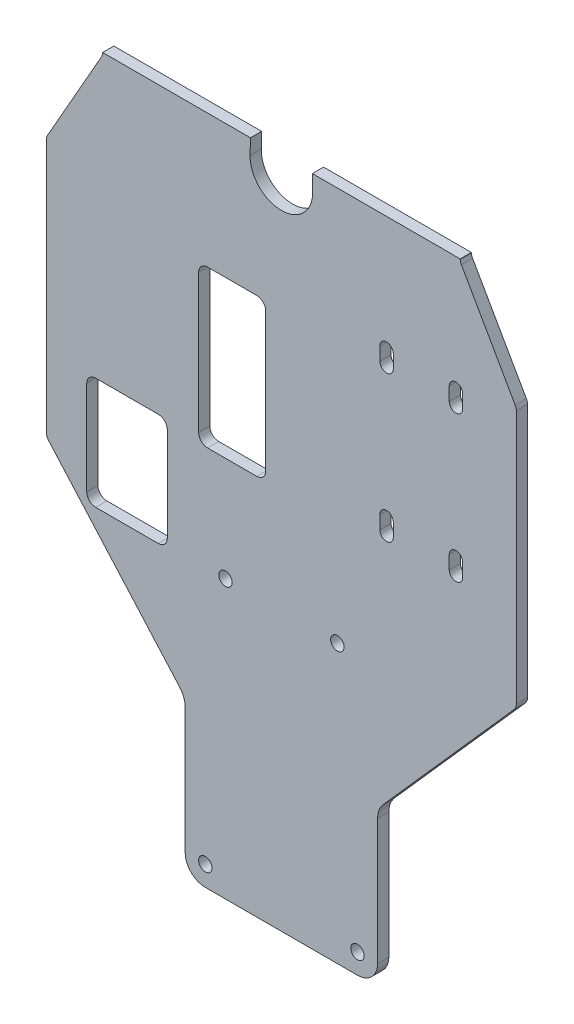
ISO-10303-21;
HEADER;
FILE_DESCRIPTION(('STEP AP214'),'2;1');
FILE_NAME('part.step','',(''),(''),'','','');
FILE_SCHEMA(('AUTOMOTIVE_DESIGN { 1 0 10303 214 1 1 1 1 }'));
ENDSEC;
DATA;
#1=APPLICATION_CONTEXT('core data for automotive mechanical design processes');
#2=APPLICATION_PROTOCOL_DEFINITION('international standard','automotive_design',2000,#1);
#3=PRODUCT_CONTEXT('',#1,'mechanical');
#4=PRODUCT('Part','Part','',(#3));
#5=PRODUCT_RELATED_PRODUCT_CATEGORY('part','',(#4));
#6=PRODUCT_DEFINITION_FORMATION('','',#4);
#7=PRODUCT_DEFINITION_CONTEXT('part definition',#1,'design');
#8=PRODUCT_DEFINITION('design','',#6,#7);
#9=PRODUCT_DEFINITION_SHAPE('','',#8);
#10=(LENGTH_UNIT() NAMED_UNIT(*) SI_UNIT(.MILLI.,.METRE.));
#11=(NAMED_UNIT(*) PLANE_ANGLE_UNIT() SI_UNIT($,.RADIAN.));
#12=(NAMED_UNIT(*) SI_UNIT($,.STERADIAN.) SOLID_ANGLE_UNIT());
#13=UNCERTAINTY_MEASURE_WITH_UNIT(LENGTH_MEASURE(1.E-05),#10,'distance_accuracy_value','');
#14=(GEOMETRIC_REPRESENTATION_CONTEXT(3) GLOBAL_UNCERTAINTY_ASSIGNED_CONTEXT((#13)) GLOBAL_UNIT_ASSIGNED_CONTEXT((#10,
#11,#12)) REPRESENTATION_CONTEXT('',''));
#15=CARTESIAN_POINT('',(0.,0.,0.));
#16=DIRECTION('',(0.,0.,1.));
#17=DIRECTION('',(1.,0.,0.));
#18=AXIS2_PLACEMENT_3D('',#15,#16,#17);
#19=CARTESIAN_POINT('',(1.90460463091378E-13,-125.8,0.));
#20=DIRECTION('',(0.,0.,-1.));
#21=DIRECTION('',(-1.,0.,0.));
#22=AXIS2_PLACEMENT_3D('',#19,#20,#21);
#23=CYLINDRICAL_SURFACE('',#22,6.99999999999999);
#24=CARTESIAN_POINT('',(1.90460463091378E-13,-125.8,-2.5));
#25=DIRECTION('',(0.,0.,1.));
#26=DIRECTION('',(1.,0.,0.));
#27=AXIS2_PLACEMENT_3D('',#24,#25,#26);
#28=CIRCLE('',#27,6.99999999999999);
#29=CARTESIAN_POINT('',(-6.99819191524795,-125.640909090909,-2.5));
#30=VERTEX_POINT('',#29);
#31=CARTESIAN_POINT('',(6.99819191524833,-125.640909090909,-2.5));
#32=VERTEX_POINT('',#31);
#33=EDGE_CURVE('E963',#30,#32,#28,.T.);
#34=ORIENTED_EDGE('',*,*,#33,.F.);
#35=DIRECTION('',(0.,0.,-1.));
#36=VECTOR('',#35,1.);
#37=CARTESIAN_POINT('',(-6.99819191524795,-125.640909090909,0.));
#38=LINE('',#37,#36);
#39=CARTESIAN_POINT('',(-6.99819191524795,-125.640909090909,0.));
#40=VERTEX_POINT('',#39);
#41=EDGE_CURVE('E11',#40,#30,#38,.T.);
#42=ORIENTED_EDGE('',*,*,#41,.F.);
#43=CARTESIAN_POINT('',(1.90460463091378E-13,-125.8,0.));
#44=DIRECTION('',(0.,0.,1.));
#45=DIRECTION('',(1.,0.,0.));
#46=AXIS2_PLACEMENT_3D('',#43,#44,#45);
#47=CIRCLE('',#46,6.99999999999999);
#48=CARTESIAN_POINT('',(6.99819191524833,-125.640909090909,0.));
#49=VERTEX_POINT('',#48);
#50=EDGE_CURVE('E1055',#40,#49,#47,.T.);
#51=ORIENTED_EDGE('',*,*,#50,.T.);
#52=DIRECTION('',(0.,0.,-1.));
#53=VECTOR('',#52,1.);
#54=CARTESIAN_POINT('',(6.99819191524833,-125.640909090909,0.));
#55=LINE('',#54,#53);
#56=EDGE_CURVE('E355',#49,#32,#55,.T.);
#57=ORIENTED_EDGE('',*,*,#56,.T.);
#58=EDGE_LOOP('',(#34,#42,#51,#57));
#59=FACE_BOUND('',#58,.T.);
#60=ADVANCED_FACE('F352',(#59),#23,.F.);
#61=CARTESIAN_POINT('',(-6.9198033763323,-122.192704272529,0.));
#62=DIRECTION('',(0.999741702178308,-0.0227272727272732,0.));
#63=DIRECTION('',(0.0227272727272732,0.999741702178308,0.));
#64=AXIS2_PLACEMENT_3D('',#61,#62,#63);
#65=PLANE('',#64);
#66=DIRECTION('',(-0.0227272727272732,-0.999741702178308,0.));
#67=VECTOR('',#66,1.);
#68=CARTESIAN_POINT('',(-6.9198033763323,-122.192704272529,-2.5));
#69=LINE('',#68,#67);
#70=CARTESIAN_POINT('',(-6.9198033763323,-122.192704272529,-2.5));
#71=VERTEX_POINT('',#70);
#72=EDGE_CURVE('E1052',#71,#30,#69,.T.);
#73=ORIENTED_EDGE('',*,*,#72,.F.);
#74=DIRECTION('',(0.,0.,-1.));
#75=VECTOR('',#74,1.);
#76=CARTESIAN_POINT('',(-6.9198033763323,-122.192704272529,0.));
#77=LINE('',#76,#75);
#78=CARTESIAN_POINT('',(-6.9198033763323,-122.192704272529,0.));
#79=VERTEX_POINT('',#78);
#80=EDGE_CURVE('E360',#79,#71,#77,.T.);
#81=ORIENTED_EDGE('',*,*,#80,.F.);
#82=DIRECTION('',(-0.0227272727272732,-0.999741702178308,0.));
#83=VECTOR('',#82,1.);
#84=CARTESIAN_POINT('',(-6.9198033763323,-122.192704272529,0.));
#85=LINE('',#84,#83);
#86=EDGE_CURVE('E1130',#79,#40,#85,.T.);
#87=ORIENTED_EDGE('',*,*,#86,.T.);
#88=ORIENTED_EDGE('',*,*,#41,.T.);
#89=EDGE_LOOP('',(#73,#81,#87,#88));
#90=FACE_BOUND('',#89,.T.);
#91=ADVANCED_FACE('F1190',(#90),#65,.T.);
#92=CARTESIAN_POINT('',(-39.9478813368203,-122.192704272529,0.));
#93=DIRECTION('',(0.,1.,0.));
#94=DIRECTION('',(-1.,0.,0.));
#95=AXIS2_PLACEMENT_3D('',#92,#93,#94);
#96=PLANE('',#95);
#97=DIRECTION('',(1.,0.,0.));
#98=VECTOR('',#97,1.);
#99=CARTESIAN_POINT('',(-39.9478813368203,-122.192704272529,-2.5));
#100=LINE('',#99,#98);
#101=CARTESIAN_POINT('',(-39.9478813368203,-122.192704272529,-2.5));
#102=VERTEX_POINT('',#101);
#103=EDGE_CURVE('E1049',#102,#71,#100,.T.);
#104=ORIENTED_EDGE('',*,*,#103,.F.);
#105=DIRECTION('',(0.,0.,-1.));
#106=VECTOR('',#105,1.);
#107=CARTESIAN_POINT('',(-39.9478813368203,-122.192704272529,0.));
#108=LINE('',#107,#106);
#109=CARTESIAN_POINT('',(-39.9478813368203,-122.192704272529,0.));
#110=VERTEX_POINT('',#109);
#111=EDGE_CURVE('E1134',#110,#102,#108,.T.);
#112=ORIENTED_EDGE('',*,*,#111,.F.);
#113=DIRECTION('',(1.,0.,0.));
#114=VECTOR('',#113,1.);
#115=CARTESIAN_POINT('',(-39.9478813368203,-122.192704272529,0.));
#116=LINE('',#115,#114);
#117=EDGE_CURVE('E1127',#110,#79,#116,.T.);
#118=ORIENTED_EDGE('',*,*,#117,.T.);
#119=ORIENTED_EDGE('',*,*,#80,.T.);
#120=EDGE_LOOP('',(#104,#112,#118,#119));
#121=FACE_BOUND('',#120,.T.);
#122=ADVANCED_FACE('F1283',(#121),#96,.T.);
#123=CARTESIAN_POINT('',(-39.9625578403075,-122.363717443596,0.));
#124=DIRECTION('',(-0.996337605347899,0.0855065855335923,0.));
#125=DIRECTION('',(-0.0855065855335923,-0.996337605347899,0.));
#126=AXIS2_PLACEMENT_3D('',#123,#124,#125);
#127=PLANE('',#126);
#128=DIRECTION('',(0.0855065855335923,0.996337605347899,0.));
#129=VECTOR('',#128,1.);
#130=CARTESIAN_POINT('',(-39.9625578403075,-122.363717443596,-2.5));
#131=LINE('',#130,#129);
#132=CARTESIAN_POINT('',(-39.9625578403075,-122.363717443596,-2.5));
#133=VERTEX_POINT('',#132);
#134=EDGE_CURVE('E1046',#133,#102,#131,.T.);
#135=ORIENTED_EDGE('',*,*,#134,.F.);
#136=DIRECTION('',(0.,0.,-1.));
#137=VECTOR('',#136,1.);
#138=CARTESIAN_POINT('',(-39.9625578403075,-122.363717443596,0.));
#139=LINE('',#138,#137);
#140=CARTESIAN_POINT('',(-39.9625578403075,-122.363717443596,0.));
#141=VERTEX_POINT('',#140);
#142=EDGE_CURVE('E1136',#141,#133,#139,.T.);
#143=ORIENTED_EDGE('',*,*,#142,.F.);
#144=DIRECTION('',(0.0855065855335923,0.996337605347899,0.));
#145=VECTOR('',#144,1.);
#146=CARTESIAN_POINT('',(-39.9625578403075,-122.363717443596,0.));
#147=LINE('',#146,#145);
#148=EDGE_CURVE('E1124',#141,#110,#147,.T.);
#149=ORIENTED_EDGE('',*,*,#148,.T.);
#150=ORIENTED_EDGE('',*,*,#111,.T.);
#151=EDGE_LOOP('',(#135,#143,#149,#150));
#152=FACE_BOUND('',#151,.T.);
#153=ADVANCED_FACE('F1281',(#152),#127,.T.);
#154=CARTESIAN_POINT('',(-41.9552330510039,-122.192704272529,0.));
#155=DIRECTION('',(0.,0.,-1.));
#156=DIRECTION('',(-1.,0.,0.));
#157=AXIS2_PLACEMENT_3D('',#154,#155,#156);
#158=CYLINDRICAL_SURFACE('',#157,2.00000000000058);
#159=CARTESIAN_POINT('',(-41.9552330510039,-122.192704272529,-2.5));
#160=DIRECTION('',(0.,0.,1.));
#161=DIRECTION('',(1.,0.,0.));
#162=AXIS2_PLACEMENT_3D('',#159,#160,#161);
#163=CIRCLE('',#162,2.00000000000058);
#164=CARTESIAN_POINT('',(-40.2163199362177,-123.180723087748,-2.5));
#165=VERTEX_POINT('',#164);
#166=EDGE_CURVE('E1043',#165,#133,#163,.T.);
#167=ORIENTED_EDGE('',*,*,#166,.F.);
#168=DIRECTION('',(0.,0.,-1.));
#169=VECTOR('',#168,1.);
#170=CARTESIAN_POINT('',(-40.2163199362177,-123.180723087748,0.));
#171=LINE('',#170,#169);
#172=CARTESIAN_POINT('',(-40.2163199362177,-123.180723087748,0.));
#173=VERTEX_POINT('',#172);
#174=EDGE_CURVE('E1138',#173,#165,#171,.T.);
#175=ORIENTED_EDGE('',*,*,#174,.F.);
#176=CARTESIAN_POINT('',(-41.9552330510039,-122.192704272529,0.));
#177=DIRECTION('',(0.,0.,1.));
#178=DIRECTION('',(1.,0.,0.));
#179=AXIS2_PLACEMENT_3D('',#176,#177,#178);
#180=CIRCLE('',#179,2.00000000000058);
#181=EDGE_CURVE('E1121',#173,#141,#180,.T.);
#182=ORIENTED_EDGE('',*,*,#181,.T.);
#183=ORIENTED_EDGE('',*,*,#142,.T.);
#184=EDGE_LOOP('',(#167,#175,#182,#183));
#185=FACE_BOUND('',#184,.T.);
#186=ADVANCED_FACE('F1277',(#185),#158,.F.);
#187=CARTESIAN_POINT('',(-52.238913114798,-144.340487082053,0.));
#188=DIRECTION('',(-0.869456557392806,0.49400940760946,0.));
#189=DIRECTION('',(-0.49400940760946,-0.869456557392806,0.));
#190=AXIS2_PLACEMENT_3D('',#187,#188,#189);
#191=PLANE('',#190);
#192=DIRECTION('',(0.49400940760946,0.869456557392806,0.));
#193=VECTOR('',#192,1.);
#194=CARTESIAN_POINT('',(-52.238913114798,-144.340487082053,-2.5));
#195=LINE('',#194,#193);
#196=CARTESIAN_POINT('',(-52.238913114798,-144.340487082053,-2.5));
#197=VERTEX_POINT('',#196);
#198=EDGE_CURVE('E1040',#197,#165,#195,.T.);
#199=ORIENTED_EDGE('',*,*,#198,.F.);
#200=DIRECTION('',(0.,0.,-1.));
#201=VECTOR('',#200,1.);
#202=CARTESIAN_POINT('',(-52.238913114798,-144.340487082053,0.));
#203=LINE('',#202,#201);
#204=CARTESIAN_POINT('',(-52.238913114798,-144.340487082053,0.));
#205=VERTEX_POINT('',#204);
#206=EDGE_CURVE('E1140',#205,#197,#203,.T.);
#207=ORIENTED_EDGE('',*,*,#206,.F.);
#208=DIRECTION('',(0.49400940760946,0.869456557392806,0.));
#209=VECTOR('',#208,1.);
#210=CARTESIAN_POINT('',(-52.238913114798,-144.340487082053,0.));
#211=LINE('',#210,#209);
#212=EDGE_CURVE('E1118',#205,#173,#211,.T.);
#213=ORIENTED_EDGE('',*,*,#212,.T.);
#214=ORIENTED_EDGE('',*,*,#174,.T.);
#215=EDGE_LOOP('',(#199,#207,#213,#214));
#216=FACE_BOUND('',#215,.T.);
#217=ADVANCED_FACE('F1273',(#216),#191,.T.);
#218=CARTESIAN_POINT('',(-50.5000000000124,-145.328505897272,0.));
#219=DIRECTION('',(0.,0.,-1.));
#220=DIRECTION('',(-1.,0.,0.));
#221=AXIS2_PLACEMENT_3D('',#218,#219,#220);
#222=CYLINDRICAL_SURFACE('',#221,2.00000000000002);
#223=CARTESIAN_POINT('',(-50.5000000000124,-145.328505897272,-2.5));
#224=DIRECTION('',(0.,0.,-1.));
#225=DIRECTION('',(-1.,0.,0.));
#226=AXIS2_PLACEMENT_3D('',#223,#224,#225);
#227=CIRCLE('',#226,2.00000000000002);
#228=CARTESIAN_POINT('',(-52.5000000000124,-145.328505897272,-2.5));
#229=VERTEX_POINT('',#228);
#230=EDGE_CURVE('E1037',#229,#197,#227,.T.);
#231=ORIENTED_EDGE('',*,*,#230,.F.);
#232=DIRECTION('',(0.,0.,-1.));
#233=VECTOR('',#232,1.);
#234=CARTESIAN_POINT('',(-52.5000000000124,-145.328505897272,0.));
#235=LINE('',#234,#233);
#236=CARTESIAN_POINT('',(-52.5000000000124,-145.328505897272,0.));
#237=VERTEX_POINT('',#236);
#238=EDGE_CURVE('E1142',#237,#229,#235,.T.);
#239=ORIENTED_EDGE('',*,*,#238,.F.);
#240=CARTESIAN_POINT('',(-50.5000000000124,-145.328505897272,0.));
#241=DIRECTION('',(0.,0.,-1.));
#242=DIRECTION('',(-1.,0.,0.));
#243=AXIS2_PLACEMENT_3D('',#240,#241,#242);
#244=CIRCLE('',#243,2.00000000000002);
#245=EDGE_CURVE('E1115',#237,#205,#244,.T.);
#246=ORIENTED_EDGE('',*,*,#245,.T.);
#247=ORIENTED_EDGE('',*,*,#206,.T.);
#248=EDGE_LOOP('',(#231,#239,#246,#247));
#249=FACE_BOUND('',#248,.T.);
#250=ADVANCED_FACE('F1269',(#249),#222,.T.);
#251=CARTESIAN_POINT('',(-52.5000000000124,-202.041633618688,0.));
#252=DIRECTION('',(-1.,0.,0.));
#253=DIRECTION('',(0.,-1.,0.));
#254=AXIS2_PLACEMENT_3D('',#251,#252,#253);
#255=PLANE('',#254);
#256=DIRECTION('',(0.,1.,0.));
#257=VECTOR('',#256,1.);
#258=CARTESIAN_POINT('',(-52.5000000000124,-202.041633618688,-2.5));
#259=LINE('',#258,#257);
#260=CARTESIAN_POINT('',(-52.5000000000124,-202.041633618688,-2.5));
#261=VERTEX_POINT('',#260);
#262=EDGE_CURVE('E1034',#261,#229,#259,.T.);
#263=ORIENTED_EDGE('',*,*,#262,.F.);
#264=DIRECTION('',(0.,0.,-1.));
#265=VECTOR('',#264,1.);
#266=CARTESIAN_POINT('',(-52.5000000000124,-202.041633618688,0.));
#267=LINE('',#266,#265);
#268=CARTESIAN_POINT('',(-52.5000000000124,-202.041633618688,0.));
#269=VERTEX_POINT('',#268);
#270=EDGE_CURVE('E1144',#269,#261,#267,.T.);
#271=ORIENTED_EDGE('',*,*,#270,.F.);
#272=DIRECTION('',(0.,1.,0.));
#273=VECTOR('',#272,1.);
#274=CARTESIAN_POINT('',(-52.5000000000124,-202.041633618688,0.));
#275=LINE('',#274,#273);
#276=EDGE_CURVE('E1112',#269,#237,#275,.T.);
#277=ORIENTED_EDGE('',*,*,#276,.T.);
#278=ORIENTED_EDGE('',*,*,#238,.T.);
#279=EDGE_LOOP('',(#263,#271,#277,#278));
#280=FACE_BOUND('',#279,.T.);
#281=ADVANCED_FACE('F1265',(#280),#255,.T.);
#282=CARTESIAN_POINT('',(-50.50000000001,-202.041633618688,0.));
#283=DIRECTION('',(0.,0.,-1.));
#284=DIRECTION('',(-1.,0.,0.));
#285=AXIS2_PLACEMENT_3D('',#282,#283,#284);
#286=CYLINDRICAL_SURFACE('',#285,2.00000000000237);
#287=CARTESIAN_POINT('',(-50.50000000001,-202.041633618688,-2.5));
#288=DIRECTION('',(0.,0.,-1.));
#289=DIRECTION('',(-1.,0.,0.));
#290=AXIS2_PLACEMENT_3D('',#287,#288,#289);
#291=CIRCLE('',#290,2.00000000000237);
#292=CARTESIAN_POINT('',(-51.9971763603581,-203.367704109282,-2.5));
#293=VERTEX_POINT('',#292);
#294=EDGE_CURVE('E1031',#293,#261,#291,.T.);
#295=ORIENTED_EDGE('',*,*,#294,.F.);
#296=DIRECTION('',(0.,0.,-1.));
#297=VECTOR('',#296,1.);
#298=CARTESIAN_POINT('',(-51.9971763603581,-203.367704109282,0.));
#299=LINE('',#298,#297);
#300=CARTESIAN_POINT('',(-51.9971763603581,-203.367704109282,0.));
#301=VERTEX_POINT('',#300);
#302=EDGE_CURVE('E1146',#301,#293,#299,.T.);
#303=ORIENTED_EDGE('',*,*,#302,.F.);
#304=CARTESIAN_POINT('',(-50.50000000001,-202.041633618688,0.));
#305=DIRECTION('',(0.,0.,-1.));
#306=DIRECTION('',(-1.,0.,0.));
#307=AXIS2_PLACEMENT_3D('',#304,#305,#306);
#308=CIRCLE('',#307,2.00000000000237);
#309=EDGE_CURVE('E1109',#301,#269,#308,.T.);
#310=ORIENTED_EDGE('',*,*,#309,.T.);
#311=ORIENTED_EDGE('',*,*,#270,.T.);
#312=EDGE_LOOP('',(#295,#303,#310,#311));
#313=FACE_BOUND('',#312,.T.);
#314=ADVANCED_FACE('F1261',(#313),#286,.T.);
#315=CARTESIAN_POINT('',(-22.7570590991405,-236.380739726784,0.));
#316=DIRECTION('',(-0.748588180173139,-0.663035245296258,0.));
#317=DIRECTION('',(0.663035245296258,-0.748588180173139,0.));
#318=AXIS2_PLACEMENT_3D('',#315,#316,#317);
#319=PLANE('',#318);
#320=DIRECTION('',(-0.663035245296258,0.748588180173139,0.));
#321=VECTOR('',#320,1.);
#322=CARTESIAN_POINT('',(-22.7570590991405,-236.380739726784,-2.5));
#323=LINE('',#322,#321);
#324=CARTESIAN_POINT('',(-22.7570590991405,-236.380739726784,-2.5));
#325=VERTEX_POINT('',#324);
#326=EDGE_CURVE('E1028',#325,#293,#323,.T.);
#327=ORIENTED_EDGE('',*,*,#326,.F.);
#328=DIRECTION('',(0.,0.,-1.));
#329=VECTOR('',#328,1.);
#330=CARTESIAN_POINT('',(-22.7570590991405,-236.380739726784,0.));
#331=LINE('',#330,#329);
#332=CARTESIAN_POINT('',(-22.7570590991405,-236.380739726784,0.));
#333=VERTEX_POINT('',#332);
#334=EDGE_CURVE('E1148',#333,#325,#331,.T.);
#335=ORIENTED_EDGE('',*,*,#334,.F.);
#336=DIRECTION('',(-0.663035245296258,0.748588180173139,0.));
#337=VECTOR('',#336,1.);
#338=CARTESIAN_POINT('',(-22.7570590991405,-236.380739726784,0.));
#339=LINE('',#338,#337);
#340=EDGE_CURVE('E1106',#333,#301,#339,.T.);
#341=ORIENTED_EDGE('',*,*,#340,.T.);
#342=ORIENTED_EDGE('',*,*,#302,.T.);
#343=EDGE_LOOP('',(#327,#335,#341,#342));
#344=FACE_BOUND('',#343,.T.);
#345=ADVANCED_FACE('F1257',(#344),#319,.T.);
#346=CARTESIAN_POINT('',(-26.5000000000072,-239.695915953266,0.));
#347=DIRECTION('',(0.,0.,-1.));
#348=DIRECTION('',(-1.,0.,0.));
#349=AXIS2_PLACEMENT_3D('',#346,#347,#348);
#350=CYLINDRICAL_SURFACE('',#349,5.00000000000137);
#351=CARTESIAN_POINT('',(-26.5000000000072,-239.695915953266,-2.5));
#352=DIRECTION('',(0.,0.,1.));
#353=DIRECTION('',(1.,0.,0.));
#354=AXIS2_PLACEMENT_3D('',#351,#352,#353);
#355=CIRCLE('',#354,5.00000000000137);
#356=CARTESIAN_POINT('',(-21.5000000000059,-239.695915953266,-2.5));
#357=VERTEX_POINT('',#356);
#358=EDGE_CURVE('E1025',#357,#325,#355,.T.);
#359=ORIENTED_EDGE('',*,*,#358,.F.);
#360=DIRECTION('',(0.,0.,-1.));
#361=VECTOR('',#360,1.);
#362=CARTESIAN_POINT('',(-21.5000000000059,-239.695915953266,0.));
#363=LINE('',#362,#361);
#364=CARTESIAN_POINT('',(-21.5000000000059,-239.695915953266,0.));
#365=VERTEX_POINT('',#364);
#366=EDGE_CURVE('E1150',#365,#357,#363,.T.);
#367=ORIENTED_EDGE('',*,*,#366,.F.);
#368=CARTESIAN_POINT('',(-26.5000000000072,-239.695915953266,0.));
#369=DIRECTION('',(0.,0.,1.));
#370=DIRECTION('',(1.,0.,0.));
#371=AXIS2_PLACEMENT_3D('',#368,#369,#370);
#372=CIRCLE('',#371,5.00000000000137);
#373=EDGE_CURVE('E1103',#365,#333,#372,.T.);
#374=ORIENTED_EDGE('',*,*,#373,.T.);
#375=ORIENTED_EDGE('',*,*,#334,.T.);
#376=EDGE_LOOP('',(#359,#367,#374,#375));
#377=FACE_BOUND('',#376,.T.);
#378=ADVANCED_FACE('F1253',(#377),#350,.F.);
#379=CARTESIAN_POINT('',(-21.5000000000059,-267.799999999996,0.));
#380=DIRECTION('',(-1.,0.,0.));
#381=DIRECTION('',(0.,-1.,0.));
#382=AXIS2_PLACEMENT_3D('',#379,#380,#381);
#383=PLANE('',#382);
#384=DIRECTION('',(0.,1.,0.));
#385=VECTOR('',#384,1.);
#386=CARTESIAN_POINT('',(-21.5000000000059,-267.799999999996,-2.5));
#387=LINE('',#386,#385);
#388=CARTESIAN_POINT('',(-21.5000000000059,-267.799999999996,-2.5));
#389=VERTEX_POINT('',#388);
#390=EDGE_CURVE('E1022',#389,#357,#387,.T.);
#391=ORIENTED_EDGE('',*,*,#390,.F.);
#392=DIRECTION('',(0.,0.,-1.));
#393=VECTOR('',#392,1.);
#394=CARTESIAN_POINT('',(-21.5000000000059,-267.799999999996,0.));
#395=LINE('',#394,#393);
#396=CARTESIAN_POINT('',(-21.5000000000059,-267.799999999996,0.));
#397=VERTEX_POINT('',#396);
#398=EDGE_CURVE('E1152',#397,#389,#395,.T.);
#399=ORIENTED_EDGE('',*,*,#398,.F.);
#400=DIRECTION('',(0.,1.,0.));
#401=VECTOR('',#400,1.);
#402=CARTESIAN_POINT('',(-21.5000000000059,-267.799999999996,0.));
#403=LINE('',#402,#401);
#404=EDGE_CURVE('E1100',#397,#365,#403,.T.);
#405=ORIENTED_EDGE('',*,*,#404,.T.);
#406=ORIENTED_EDGE('',*,*,#366,.T.);
#407=EDGE_LOOP('',(#391,#399,#405,#406));
#408=FACE_BOUND('',#407,.T.);
#409=ADVANCED_FACE('F1249',(#408),#383,.T.);
#410=CARTESIAN_POINT('',(-17.0000000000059,-267.799999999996,0.));
#411=DIRECTION('',(0.,0.,-1.));
#412=DIRECTION('',(-1.,0.,0.));
#413=AXIS2_PLACEMENT_3D('',#410,#411,#412);
#414=CYLINDRICAL_SURFACE('',#413,4.50000000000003);
#415=CARTESIAN_POINT('',(-17.0000000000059,-267.799999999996,-2.5));
#416=DIRECTION('',(0.,0.,-1.));
#417=DIRECTION('',(-1.,0.,0.));
#418=AXIS2_PLACEMENT_3D('',#415,#416,#417);
#419=CIRCLE('',#418,4.50000000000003);
#420=CARTESIAN_POINT('',(-17.0000000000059,-272.299999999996,-2.5));
#421=VERTEX_POINT('',#420);
#422=EDGE_CURVE('E1019',#421,#389,#419,.T.);
#423=ORIENTED_EDGE('',*,*,#422,.F.);
#424=DIRECTION('',(0.,0.,-1.));
#425=VECTOR('',#424,1.);
#426=CARTESIAN_POINT('',(-17.0000000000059,-272.299999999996,0.));
#427=LINE('',#426,#425);
#428=CARTESIAN_POINT('',(-17.0000000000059,-272.299999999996,0.));
#429=VERTEX_POINT('',#428);
#430=EDGE_CURVE('E1154',#429,#421,#427,.T.);
#431=ORIENTED_EDGE('',*,*,#430,.F.);
#432=CARTESIAN_POINT('',(-17.0000000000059,-267.799999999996,0.));
#433=DIRECTION('',(0.,0.,-1.));
#434=DIRECTION('',(-1.,0.,0.));
#435=AXIS2_PLACEMENT_3D('',#432,#433,#434);
#436=CIRCLE('',#435,4.50000000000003);
#437=EDGE_CURVE('E1097',#429,#397,#436,.T.);
#438=ORIENTED_EDGE('',*,*,#437,.T.);
#439=ORIENTED_EDGE('',*,*,#398,.T.);
#440=EDGE_LOOP('',(#423,#431,#438,#439));
#441=FACE_BOUND('',#440,.T.);
#442=ADVANCED_FACE('F1245',(#441),#414,.T.);
#443=CARTESIAN_POINT('',(16.9999999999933,-272.299999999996,0.));
#444=DIRECTION('',(0.,-1.,0.));
#445=DIRECTION('',(1.,0.,0.));
#446=AXIS2_PLACEMENT_3D('',#443,#444,#445);
#447=PLANE('',#446);
#448=DIRECTION('',(-1.,0.,0.));
#449=VECTOR('',#448,1.);
#450=CARTESIAN_POINT('',(16.9999999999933,-272.299999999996,-2.5));
#451=LINE('',#450,#449);
#452=CARTESIAN_POINT('',(16.9999999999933,-272.299999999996,-2.5));
#453=VERTEX_POINT('',#452);
#454=EDGE_CURVE('E1016',#453,#421,#451,.T.);
#455=ORIENTED_EDGE('',*,*,#454,.F.);
#456=DIRECTION('',(0.,0.,-1.));
#457=VECTOR('',#456,1.);
#458=CARTESIAN_POINT('',(16.9999999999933,-272.299999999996,0.));
#459=LINE('',#458,#457);
#460=CARTESIAN_POINT('',(16.9999999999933,-272.299999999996,0.));
#461=VERTEX_POINT('',#460);
#462=EDGE_CURVE('E1156',#461,#453,#459,.T.);
#463=ORIENTED_EDGE('',*,*,#462,.F.);
#464=DIRECTION('',(-1.,0.,0.));
#465=VECTOR('',#464,1.);
#466=CARTESIAN_POINT('',(16.9999999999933,-272.299999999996,0.));
#467=LINE('',#466,#465);
#468=EDGE_CURVE('E1094',#461,#429,#467,.T.);
#469=ORIENTED_EDGE('',*,*,#468,.T.);
#470=ORIENTED_EDGE('',*,*,#430,.T.);
#471=EDGE_LOOP('',(#455,#463,#469,#470));
#472=FACE_BOUND('',#471,.T.);
#473=ADVANCED_FACE('F1241',(#472),#447,.T.);
#474=CARTESIAN_POINT('',(16.9999999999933,-267.799999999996,0.));
#475=DIRECTION('',(0.,0.,-1.));
#476=DIRECTION('',(-1.,0.,0.));
#477=AXIS2_PLACEMENT_3D('',#474,#475,#476);
#478=CYLINDRICAL_SURFACE('',#477,4.5);
#479=CARTESIAN_POINT('',(16.9999999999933,-267.799999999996,-2.5));
#480=DIRECTION('',(0.,0.,-1.));
#481=DIRECTION('',(-1.,0.,0.));
#482=AXIS2_PLACEMENT_3D('',#479,#480,#481);
#483=CIRCLE('',#482,4.5);
#484=CARTESIAN_POINT('',(21.4999999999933,-267.799999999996,-2.5));
#485=VERTEX_POINT('',#484);
#486=EDGE_CURVE('E1013',#485,#453,#483,.T.);
#487=ORIENTED_EDGE('',*,*,#486,.F.);
#488=DIRECTION('',(0.,0.,-1.));
#489=VECTOR('',#488,1.);
#490=CARTESIAN_POINT('',(21.4999999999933,-267.799999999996,0.));
#491=LINE('',#490,#489);
#492=CARTESIAN_POINT('',(21.4999999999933,-267.799999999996,0.));
#493=VERTEX_POINT('',#492);
#494=EDGE_CURVE('E1158',#493,#485,#491,.T.);
#495=ORIENTED_EDGE('',*,*,#494,.F.);
#496=CARTESIAN_POINT('',(16.9999999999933,-267.799999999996,0.));
#497=DIRECTION('',(0.,0.,-1.));
#498=DIRECTION('',(-1.,0.,0.));
#499=AXIS2_PLACEMENT_3D('',#496,#497,#498);
#500=CIRCLE('',#499,4.5);
#501=EDGE_CURVE('E1091',#493,#461,#500,.T.);
#502=ORIENTED_EDGE('',*,*,#501,.T.);
#503=ORIENTED_EDGE('',*,*,#462,.T.);
#504=EDGE_LOOP('',(#487,#495,#502,#503));
#505=FACE_BOUND('',#504,.T.);
#506=ADVANCED_FACE('F1237',(#505),#478,.T.);
#507=CARTESIAN_POINT('',(21.4999999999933,-239.695915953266,0.));
#508=DIRECTION('',(1.,0.,0.));
#509=DIRECTION('',(0.,1.,0.));
#510=AXIS2_PLACEMENT_3D('',#507,#508,#509);
#511=PLANE('',#510);
#512=DIRECTION('',(0.,-1.,0.));
#513=VECTOR('',#512,1.);
#514=CARTESIAN_POINT('',(21.4999999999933,-239.695915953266,-2.5));
#515=LINE('',#514,#513);
#516=CARTESIAN_POINT('',(21.4999999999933,-239.695915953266,-2.5));
#517=VERTEX_POINT('',#516);
#518=EDGE_CURVE('E1010',#517,#485,#515,.T.);
#519=ORIENTED_EDGE('',*,*,#518,.F.);
#520=DIRECTION('',(0.,0.,-1.));
#521=VECTOR('',#520,1.);
#522=CARTESIAN_POINT('',(21.4999999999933,-239.695915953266,0.));
#523=LINE('',#522,#521);
#524=CARTESIAN_POINT('',(21.4999999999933,-239.695915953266,0.));
#525=VERTEX_POINT('',#524);
#526=EDGE_CURVE('E1160',#525,#517,#523,.T.);
#527=ORIENTED_EDGE('',*,*,#526,.F.);
#528=DIRECTION('',(0.,-1.,0.));
#529=VECTOR('',#528,1.);
#530=CARTESIAN_POINT('',(21.4999999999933,-239.695915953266,0.));
#531=LINE('',#530,#529);
#532=EDGE_CURVE('E1088',#525,#493,#531,.T.);
#533=ORIENTED_EDGE('',*,*,#532,.T.);
#534=ORIENTED_EDGE('',*,*,#494,.T.);
#535=EDGE_LOOP('',(#519,#527,#533,#534));
#536=FACE_BOUND('',#535,.T.);
#537=ADVANCED_FACE('F1233',(#536),#511,.T.);
#538=CARTESIAN_POINT('',(26.4999999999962,-239.695915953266,0.));
#539=DIRECTION('',(0.,0.,-1.));
#540=DIRECTION('',(-1.,0.,0.));
#541=AXIS2_PLACEMENT_3D('',#538,#539,#540);
#542=CYLINDRICAL_SURFACE('',#541,5.00000000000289);
#543=CARTESIAN_POINT('',(26.4999999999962,-239.695915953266,-2.5));
#544=DIRECTION('',(0.,0.,1.));
#545=DIRECTION('',(1.,0.,0.));
#546=AXIS2_PLACEMENT_3D('',#543,#544,#545);
#547=CIRCLE('',#546,5.00000000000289);
#548=CARTESIAN_POINT('',(22.7570590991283,-236.380739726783,-2.5));
#549=VERTEX_POINT('',#548);
#550=EDGE_CURVE('E1007',#549,#517,#547,.T.);
#551=ORIENTED_EDGE('',*,*,#550,.F.);
#552=DIRECTION('',(0.,0.,-1.));
#553=VECTOR('',#552,1.);
#554=CARTESIAN_POINT('',(22.7570590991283,-236.380739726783,0.));
#555=LINE('',#554,#553);
#556=CARTESIAN_POINT('',(22.7570590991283,-236.380739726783,0.));
#557=VERTEX_POINT('',#556);
#558=EDGE_CURVE('E1162',#557,#549,#555,.T.);
#559=ORIENTED_EDGE('',*,*,#558,.F.);
#560=CARTESIAN_POINT('',(26.4999999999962,-239.695915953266,0.));
#561=DIRECTION('',(0.,0.,1.));
#562=DIRECTION('',(1.,0.,0.));
#563=AXIS2_PLACEMENT_3D('',#560,#561,#562);
#564=CIRCLE('',#563,5.00000000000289);
#565=EDGE_CURVE('E1085',#557,#525,#564,.T.);
#566=ORIENTED_EDGE('',*,*,#565,.T.);
#567=ORIENTED_EDGE('',*,*,#526,.T.);
#568=EDGE_LOOP('',(#551,#559,#566,#567));
#569=FACE_BOUND('',#568,.T.);
#570=ADVANCED_FACE('F1229',(#569),#542,.F.);
#571=CARTESIAN_POINT('',(51.9971763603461,-203.367704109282,0.));
#572=DIRECTION('',(0.748588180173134,-0.663035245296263,0.));
#573=DIRECTION('',(0.663035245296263,0.748588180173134,0.));
#574=AXIS2_PLACEMENT_3D('',#571,#572,#573);
#575=PLANE('',#574);
#576=DIRECTION('',(-0.663035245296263,-0.748588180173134,0.));
#577=VECTOR('',#576,1.);
#578=CARTESIAN_POINT('',(51.9971763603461,-203.367704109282,-2.5));
#579=LINE('',#578,#577);
#580=CARTESIAN_POINT('',(51.9971763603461,-203.367704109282,-2.5));
#581=VERTEX_POINT('',#580);
#582=EDGE_CURVE('E1004',#581,#549,#579,.T.);
#583=ORIENTED_EDGE('',*,*,#582,.F.);
#584=DIRECTION('',(0.,0.,-1.));
#585=VECTOR('',#584,1.);
#586=CARTESIAN_POINT('',(51.9971763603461,-203.367704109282,0.));
#587=LINE('',#586,#585);
#588=CARTESIAN_POINT('',(51.9971763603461,-203.367704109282,0.));
#589=VERTEX_POINT('',#588);
#590=EDGE_CURVE('E1164',#589,#581,#587,.T.);
#591=ORIENTED_EDGE('',*,*,#590,.F.);
#592=DIRECTION('',(-0.663035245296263,-0.748588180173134,0.));
#593=VECTOR('',#592,1.);
#594=CARTESIAN_POINT('',(51.9971763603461,-203.367704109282,0.));
#595=LINE('',#594,#593);
#596=EDGE_CURVE('E1082',#589,#557,#595,.T.);
#597=ORIENTED_EDGE('',*,*,#596,.T.);
#598=ORIENTED_EDGE('',*,*,#558,.T.);
#599=EDGE_LOOP('',(#583,#591,#597,#598));
#600=FACE_BOUND('',#599,.T.);
#601=ADVANCED_FACE('F1225',(#600),#575,.T.);
#602=CARTESIAN_POINT('',(50.4999999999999,-202.041633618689,0.));
#603=DIRECTION('',(0.,0.,-1.));
#604=DIRECTION('',(-1.,0.,0.));
#605=AXIS2_PLACEMENT_3D('',#602,#603,#604);
#606=CYLINDRICAL_SURFACE('',#605,2.00000000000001);
#607=CARTESIAN_POINT('',(50.4999999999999,-202.041633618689,-2.5));
#608=DIRECTION('',(0.,0.,-1.));
#609=DIRECTION('',(-1.,0.,0.));
#610=AXIS2_PLACEMENT_3D('',#607,#608,#609);
#611=CIRCLE('',#610,2.00000000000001);
#612=CARTESIAN_POINT('',(52.4999999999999,-202.041633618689,-2.5));
#613=VERTEX_POINT('',#612);
#614=EDGE_CURVE('E1001',#613,#581,#611,.T.);
#615=ORIENTED_EDGE('',*,*,#614,.F.);
#616=DIRECTION('',(0.,0.,-1.));
#617=VECTOR('',#616,1.);
#618=CARTESIAN_POINT('',(52.4999999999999,-202.041633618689,0.));
#619=LINE('',#618,#617);
#620=CARTESIAN_POINT('',(52.4999999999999,-202.041633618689,0.));
#621=VERTEX_POINT('',#620);
#622=EDGE_CURVE('E1166',#621,#613,#619,.T.);
#623=ORIENTED_EDGE('',*,*,#622,.F.);
#624=CARTESIAN_POINT('',(50.4999999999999,-202.041633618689,0.));
#625=DIRECTION('',(0.,0.,-1.));
#626=DIRECTION('',(-1.,0.,0.));
#627=AXIS2_PLACEMENT_3D('',#624,#625,#626);
#628=CIRCLE('',#627,2.00000000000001);
#629=EDGE_CURVE('E1079',#621,#589,#628,.T.);
#630=ORIENTED_EDGE('',*,*,#629,.T.);
#631=ORIENTED_EDGE('',*,*,#590,.T.);
#632=EDGE_LOOP('',(#615,#623,#630,#631));
#633=FACE_BOUND('',#632,.T.);
#634=ADVANCED_FACE('F1221',(#633),#606,.T.);
#635=CARTESIAN_POINT('',(52.4999999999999,-145.328505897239,0.));
#636=DIRECTION('',(1.,0.,0.));
#637=DIRECTION('',(0.,0.,-1.));
#638=AXIS2_PLACEMENT_3D('',#635,#636,#637);
#639=PLANE('',#638);
#640=DIRECTION('',(0.,-1.,0.));
#641=VECTOR('',#640,1.);
#642=CARTESIAN_POINT('',(52.4999999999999,-145.328505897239,-2.5));
#643=LINE('',#642,#641);
#644=CARTESIAN_POINT('',(52.4999999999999,-145.328505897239,-2.5));
#645=VERTEX_POINT('',#644);
#646=EDGE_CURVE('E998',#645,#613,#643,.T.);
#647=ORIENTED_EDGE('',*,*,#646,.F.);
#648=DIRECTION('',(0.,0.,-1.));
#649=VECTOR('',#648,1.);
#650=CARTESIAN_POINT('',(52.4999999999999,-145.328505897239,0.));
#651=LINE('',#650,#649);
#652=CARTESIAN_POINT('',(52.4999999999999,-145.328505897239,0.));
#653=VERTEX_POINT('',#652);
#654=EDGE_CURVE('E1168',#653,#645,#651,.T.);
#655=ORIENTED_EDGE('',*,*,#654,.F.);
#656=DIRECTION('',(0.,-1.,0.));
#657=VECTOR('',#656,1.);
#658=CARTESIAN_POINT('',(52.4999999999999,-145.328505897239,0.));
#659=LINE('',#658,#657);
#660=EDGE_CURVE('E1076',#653,#621,#659,.T.);
#661=ORIENTED_EDGE('',*,*,#660,.T.);
#662=ORIENTED_EDGE('',*,*,#622,.T.);
#663=EDGE_LOOP('',(#647,#655,#661,#662));
#664=FACE_BOUND('',#663,.T.);
#665=ADVANCED_FACE('F1217',(#664),#639,.T.);
#666=CARTESIAN_POINT('',(50.4999999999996,-145.328505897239,0.));
#667=DIRECTION('',(0.,0.,-1.));
#668=DIRECTION('',(-1.,0.,0.));
#669=AXIS2_PLACEMENT_3D('',#666,#667,#668);
#670=CYLINDRICAL_SURFACE('',#669,2.00000000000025);
#671=CARTESIAN_POINT('',(50.4999999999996,-145.328505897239,-2.5));
#672=DIRECTION('',(0.,0.,-1.));
#673=DIRECTION('',(-1.,0.,0.));
#674=AXIS2_PLACEMENT_3D('',#671,#672,#673);
#675=CIRCLE('',#674,2.00000000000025);
#676=CARTESIAN_POINT('',(52.2389131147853,-144.34048708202,-2.5));
#677=VERTEX_POINT('',#676);
#678=EDGE_CURVE('E995',#677,#645,#675,.T.);
#679=ORIENTED_EDGE('',*,*,#678,.F.);
#680=DIRECTION('',(0.,0.,-1.));
#681=VECTOR('',#680,1.);
#682=CARTESIAN_POINT('',(52.2389131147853,-144.34048708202,0.));
#683=LINE('',#682,#681);
#684=CARTESIAN_POINT('',(52.2389131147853,-144.34048708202,0.));
#685=VERTEX_POINT('',#684);
#686=EDGE_CURVE('E1170',#685,#677,#683,.T.);
#687=ORIENTED_EDGE('',*,*,#686,.F.);
#688=CARTESIAN_POINT('',(50.4999999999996,-145.328505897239,0.));
#689=DIRECTION('',(0.,0.,-1.));
#690=DIRECTION('',(-1.,0.,0.));
#691=AXIS2_PLACEMENT_3D('',#688,#689,#690);
#692=CIRCLE('',#691,2.00000000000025);
#693=EDGE_CURVE('E1073',#685,#653,#692,.T.);
#694=ORIENTED_EDGE('',*,*,#693,.T.);
#695=ORIENTED_EDGE('',*,*,#654,.T.);
#696=EDGE_LOOP('',(#679,#687,#694,#695));
#697=FACE_BOUND('',#696,.T.);
#698=ADVANCED_FACE('F1213',(#697),#670,.T.);
#699=CARTESIAN_POINT('',(40.2163199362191,-123.180723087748,0.));
#700=DIRECTION('',(0.869456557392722,0.494009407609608,0.));
#701=DIRECTION('',(-0.494009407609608,0.869456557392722,0.));
#702=AXIS2_PLACEMENT_3D('',#699,#700,#701);
#703=PLANE('',#702);
#704=DIRECTION('',(0.494009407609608,-0.869456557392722,0.));
#705=VECTOR('',#704,1.);
#706=CARTESIAN_POINT('',(40.2163199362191,-123.180723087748,-2.5));
#707=LINE('',#706,#705);
#708=CARTESIAN_POINT('',(40.2163199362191,-123.180723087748,-2.5));
#709=VERTEX_POINT('',#708);
#710=EDGE_CURVE('E992',#709,#677,#707,.T.);
#711=ORIENTED_EDGE('',*,*,#710,.F.);
#712=DIRECTION('',(0.,0.,-1.));
#713=VECTOR('',#712,1.);
#714=CARTESIAN_POINT('',(40.2163199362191,-123.180723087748,0.));
#715=LINE('',#714,#713);
#716=CARTESIAN_POINT('',(40.2163199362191,-123.180723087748,0.));
#717=VERTEX_POINT('',#716);
#718=EDGE_CURVE('E1172',#717,#709,#715,.T.);
#719=ORIENTED_EDGE('',*,*,#718,.F.);
#720=DIRECTION('',(0.494009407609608,-0.869456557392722,0.));
#721=VECTOR('',#720,1.);
#722=CARTESIAN_POINT('',(40.2163199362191,-123.180723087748,0.));
#723=LINE('',#722,#721);
#724=EDGE_CURVE('E1070',#717,#685,#723,.T.);
#725=ORIENTED_EDGE('',*,*,#724,.T.);
#726=ORIENTED_EDGE('',*,*,#686,.T.);
#727=EDGE_LOOP('',(#711,#719,#725,#726));
#728=FACE_BOUND('',#727,.T.);
#729=ADVANCED_FACE('F1209',(#728),#703,.T.);
#730=CARTESIAN_POINT('',(41.9552330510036,-122.192704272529,0.));
#731=DIRECTION('',(0.,0.,-1.));
#732=DIRECTION('',(-1.,0.,0.));
#733=AXIS2_PLACEMENT_3D('',#730,#731,#732);
#734=CYLINDRICAL_SURFACE('',#733,1.99999999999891);
#735=CARTESIAN_POINT('',(41.9552330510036,-122.192704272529,-2.5));
#736=DIRECTION('',(0.,0.,1.));
#737=DIRECTION('',(1.,0.,0.));
#738=AXIS2_PLACEMENT_3D('',#735,#736,#737);
#739=CIRCLE('',#738,1.99999999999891);
#740=CARTESIAN_POINT('',(39.9625578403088,-122.363717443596,-2.5));
#741=VERTEX_POINT('',#740);
#742=EDGE_CURVE('E989',#741,#709,#739,.T.);
#743=ORIENTED_EDGE('',*,*,#742,.F.);
#744=DIRECTION('',(0.,0.,-1.));
#745=VECTOR('',#744,1.);
#746=CARTESIAN_POINT('',(39.9625578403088,-122.363717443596,0.));
#747=LINE('',#746,#745);
#748=CARTESIAN_POINT('',(39.9625578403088,-122.363717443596,0.));
#749=VERTEX_POINT('',#748);
#750=EDGE_CURVE('E1174',#749,#741,#747,.T.);
#751=ORIENTED_EDGE('',*,*,#750,.F.);
#752=CARTESIAN_POINT('',(41.9552330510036,-122.192704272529,0.));
#753=DIRECTION('',(0.,0.,1.));
#754=DIRECTION('',(1.,0.,0.));
#755=AXIS2_PLACEMENT_3D('',#752,#753,#754);
#756=CIRCLE('',#755,1.99999999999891);
#757=EDGE_CURVE('E1067',#749,#717,#756,.T.);
#758=ORIENTED_EDGE('',*,*,#757,.T.);
#759=ORIENTED_EDGE('',*,*,#718,.T.);
#760=EDGE_LOOP('',(#743,#751,#758,#759));
#761=FACE_BOUND('',#760,.T.);
#762=ADVANCED_FACE('F1205',(#761),#734,.F.);
#763=CARTESIAN_POINT('',(39.9478813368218,-122.192704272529,0.));
#764=DIRECTION('',(0.996337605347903,0.0855065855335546,0.));
#765=DIRECTION('',(-0.0855065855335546,0.996337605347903,0.));
#766=AXIS2_PLACEMENT_3D('',#763,#764,#765);
#767=PLANE('',#766);
#768=DIRECTION('',(0.0855065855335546,-0.996337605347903,0.));
#769=VECTOR('',#768,1.);
#770=CARTESIAN_POINT('',(39.9478813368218,-122.192704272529,-2.5));
#771=LINE('',#770,#769);
#772=CARTESIAN_POINT('',(39.9478813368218,-122.192704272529,-2.5));
#773=VERTEX_POINT('',#772);
#774=EDGE_CURVE('E986',#773,#741,#771,.T.);
#775=ORIENTED_EDGE('',*,*,#774,.F.);
#776=DIRECTION('',(0.,0.,-1.));
#777=VECTOR('',#776,1.);
#778=CARTESIAN_POINT('',(39.9478813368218,-122.192704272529,0.));
#779=LINE('',#778,#777);
#780=CARTESIAN_POINT('',(39.9478813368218,-122.192704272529,0.));
#781=VERTEX_POINT('',#780);
#782=EDGE_CURVE('E1176',#781,#773,#779,.T.);
#783=ORIENTED_EDGE('',*,*,#782,.F.);
#784=DIRECTION('',(0.0855065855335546,-0.996337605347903,0.));
#785=VECTOR('',#784,1.);
#786=CARTESIAN_POINT('',(39.9478813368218,-122.192704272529,0.));
#787=LINE('',#786,#785);
#788=EDGE_CURVE('E1064',#781,#749,#787,.T.);
#789=ORIENTED_EDGE('',*,*,#788,.T.);
#790=ORIENTED_EDGE('',*,*,#750,.T.);
#791=EDGE_LOOP('',(#775,#783,#789,#790));
#792=FACE_BOUND('',#791,.T.);
#793=ADVANCED_FACE('F1203',(#792),#767,.T.);
#794=CARTESIAN_POINT('',(6.91980337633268,-122.192704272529,0.));
#795=DIRECTION('',(0.,1.,0.));
#796=DIRECTION('',(0.,0.,1.));
#797=AXIS2_PLACEMENT_3D('',#794,#795,#796);
#798=PLANE('',#797);
#799=DIRECTION('',(1.,0.,0.));
#800=VECTOR('',#799,1.);
#801=CARTESIAN_POINT('',(6.91980337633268,-122.192704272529,-2.5));
#802=LINE('',#801,#800);
#803=CARTESIAN_POINT('',(6.91980337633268,-122.192704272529,-2.5));
#804=VERTEX_POINT('',#803);
#805=EDGE_CURVE('E983',#804,#773,#802,.T.);
#806=ORIENTED_EDGE('',*,*,#805,.F.);
#807=DIRECTION('',(0.,0.,-1.));
#808=VECTOR('',#807,1.);
#809=CARTESIAN_POINT('',(6.91980337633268,-122.192704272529,0.));
#810=LINE('',#809,#808);
#811=CARTESIAN_POINT('',(6.91980337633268,-122.192704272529,0.));
#812=VERTEX_POINT('',#811);
#813=EDGE_CURVE('E1177',#812,#804,#810,.T.);
#814=ORIENTED_EDGE('',*,*,#813,.F.);
#815=DIRECTION('',(1.,0.,0.));
#816=VECTOR('',#815,1.);
#817=CARTESIAN_POINT('',(6.91980337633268,-122.192704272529,0.));
#818=LINE('',#817,#816);
#819=EDGE_CURVE('E1061',#812,#781,#818,.T.);
#820=ORIENTED_EDGE('',*,*,#819,.T.);
#821=ORIENTED_EDGE('',*,*,#782,.T.);
#822=EDGE_LOOP('',(#806,#814,#820,#821));
#823=FACE_BOUND('',#822,.T.);
#824=ADVANCED_FACE('F1199',(#823),#798,.T.);
#825=CARTESIAN_POINT('',(6.99819191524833,-125.640909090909,0.));
#826=DIRECTION('',(-0.999741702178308,-0.0227272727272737,0.));
#827=DIRECTION('',(0.0227272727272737,-0.999741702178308,0.));
#828=AXIS2_PLACEMENT_3D('',#825,#826,#827);
#829=PLANE('',#828);
#830=DIRECTION('',(-0.0227272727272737,0.999741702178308,0.));
#831=VECTOR('',#830,1.);
#832=CARTESIAN_POINT('',(6.99819191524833,-125.640909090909,-2.5));
#833=LINE('',#832,#831);
#834=EDGE_CURVE('E980',#32,#804,#833,.T.);
#835=ORIENTED_EDGE('',*,*,#834,.F.);
#836=ORIENTED_EDGE('',*,*,#56,.F.);
#837=DIRECTION('',(-0.0227272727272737,0.999741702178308,0.));
#838=VECTOR('',#837,1.);
#839=CARTESIAN_POINT('',(6.99819191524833,-125.640909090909,0.));
#840=LINE('',#839,#838);
#841=EDGE_CURVE('E1058',#49,#812,#840,.T.);
#842=ORIENTED_EDGE('',*,*,#841,.T.);
#843=ORIENTED_EDGE('',*,*,#813,.T.);
#844=EDGE_LOOP('',(#835,#836,#842,#843));
#845=FACE_BOUND('',#844,.T.);
#846=ADVANCED_FACE('F1185',(#845),#829,.T.);
#847=CARTESIAN_POINT('',(1.90460463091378E-13,-125.8,0.));
#848=DIRECTION('',(0.,0.,1.));
#849=DIRECTION('',(1.,0.,0.));
#850=AXIS2_PLACEMENT_3D('',#847,#848,#849);
#851=PLANE('',#850);
#852=CARTESIAN_POINT('',(-17.0000000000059,-267.799999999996,0.));
#853=DIRECTION('',(0.,0.,-1.));
#854=DIRECTION('',(1.,0.,0.));
#855=AXIS2_PLACEMENT_3D('',#852,#853,#854);
#856=CIRCLE('',#855,1.5);
#857=CARTESIAN_POINT('',(-15.5000000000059,-267.799999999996,0.));
#858=VERTEX_POINT('',#857);
#859=EDGE_CURVE('E1738',#858,#858,#856,.T.);
#860=ORIENTED_EDGE('',*,*,#859,.T.);
#861=EDGE_LOOP('',(#860));
#862=FACE_BOUND('',#861,.T.);
#863=CARTESIAN_POINT('',(16.9999999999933,-267.799999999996,0.));
#864=DIRECTION('',(0.,0.,-1.));
#865=DIRECTION('',(1.,0.,0.));
#866=AXIS2_PLACEMENT_3D('',#863,#864,#865);
#867=CIRCLE('',#866,1.5);
#868=CARTESIAN_POINT('',(18.4999999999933,-267.799999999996,0.));
#869=VERTEX_POINT('',#868);
#870=EDGE_CURVE('E1748',#869,#869,#867,.T.);
#871=ORIENTED_EDGE('',*,*,#870,.T.);
#872=EDGE_LOOP('',(#871));
#873=FACE_BOUND('',#872,.T.);
#874=CARTESIAN_POINT('',(-12.5000000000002,-210.299999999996,0.));
#875=DIRECTION('',(0.,0.,-1.));
#876=DIRECTION('',(1.,0.,0.));
#877=AXIS2_PLACEMENT_3D('',#874,#875,#876);
#878=CIRCLE('',#877,1.5);
#879=CARTESIAN_POINT('',(-11.0000000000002,-210.299999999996,0.));
#880=VERTEX_POINT('',#879);
#881=EDGE_CURVE('E1754',#880,#880,#878,.T.);
#882=ORIENTED_EDGE('',*,*,#881,.T.);
#883=EDGE_LOOP('',(#882));
#884=FACE_BOUND('',#883,.T.);
#885=CARTESIAN_POINT('',(12.4999999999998,-210.299999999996,0.));
#886=DIRECTION('',(0.,0.,-1.));
#887=DIRECTION('',(1.,0.,0.));
#888=AXIS2_PLACEMENT_3D('',#885,#886,#887);
#889=CIRCLE('',#888,1.5);
#890=CARTESIAN_POINT('',(13.9999999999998,-210.299999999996,0.));
#891=VERTEX_POINT('',#890);
#892=EDGE_CURVE('E1760',#891,#891,#889,.T.);
#893=ORIENTED_EDGE('',*,*,#892,.T.);
#894=EDGE_LOOP('',(#893));
#895=FACE_BOUND('',#894,.T.);
#896=CARTESIAN_POINT('',(23.5,-147.999999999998,0.));
#897=DIRECTION('',(0.,0.,-1.));
#898=DIRECTION('',(1.,0.,0.));
#899=AXIS2_PLACEMENT_3D('',#896,#897,#898);
#900=CIRCLE('',#899,1.5);
#901=CARTESIAN_POINT('',(22.,-147.999999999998,0.));
#902=VERTEX_POINT('',#901);
#903=CARTESIAN_POINT('',(25.,-147.999999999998,0.));
#904=VERTEX_POINT('',#903);
#905=EDGE_CURVE('E737',#902,#904,#900,.T.);
#906=ORIENTED_EDGE('',*,*,#905,.T.);
#907=DIRECTION('',(0.,-1.,0.));
#908=VECTOR('',#907,1.);
#909=CARTESIAN_POINT('',(25.,-150.999999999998,0.));
#910=LINE('',#909,#908);
#911=CARTESIAN_POINT('',(25.,-150.999999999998,0.));
#912=VERTEX_POINT('',#911);
#913=EDGE_CURVE('E743',#904,#912,#910,.T.);
#914=ORIENTED_EDGE('',*,*,#913,.T.);
#915=CARTESIAN_POINT('',(23.5,-150.999999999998,0.));
#916=DIRECTION('',(0.,0.,-1.));
#917=DIRECTION('',(1.,0.,0.));
#918=AXIS2_PLACEMENT_3D('',#915,#916,#917);
#919=CIRCLE('',#918,1.5);
#920=CARTESIAN_POINT('',(22.,-150.999999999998,0.));
#921=VERTEX_POINT('',#920);
#922=EDGE_CURVE('E368',#912,#921,#919,.T.);
#923=ORIENTED_EDGE('',*,*,#922,.T.);
#924=DIRECTION('',(0.,1.,0.));
#925=VECTOR('',#924,1.);
#926=CARTESIAN_POINT('',(22.,-147.999999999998,0.));
#927=LINE('',#926,#925);
#928=EDGE_CURVE('E746',#921,#902,#927,.T.);
#929=ORIENTED_EDGE('',*,*,#928,.T.);
#930=EDGE_LOOP('',(#906,#914,#923,#929));
#931=FACE_BOUND('',#930,.T.);
#932=CARTESIAN_POINT('',(39.,-147.999999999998,0.));
#933=DIRECTION('',(0.,0.,-1.));
#934=DIRECTION('',(1.,0.,0.));
#935=AXIS2_PLACEMENT_3D('',#932,#933,#934);
#936=CIRCLE('',#935,1.5);
#937=CARTESIAN_POINT('',(37.5,-147.999999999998,0.));
#938=VERTEX_POINT('',#937);
#939=CARTESIAN_POINT('',(40.5,-147.999999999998,0.));
#940=VERTEX_POINT('',#939);
#941=EDGE_CURVE('E764',#938,#940,#936,.T.);
#942=ORIENTED_EDGE('',*,*,#941,.T.);
#943=DIRECTION('',(0.,-1.,0.));
#944=VECTOR('',#943,1.);
#945=CARTESIAN_POINT('',(40.5,-150.999999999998,0.));
#946=LINE('',#945,#944);
#947=CARTESIAN_POINT('',(40.5,-150.999999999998,0.));
#948=VERTEX_POINT('',#947);
#949=EDGE_CURVE('E767',#940,#948,#946,.T.);
#950=ORIENTED_EDGE('',*,*,#949,.T.);
#951=CARTESIAN_POINT('',(39.,-150.999999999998,0.));
#952=DIRECTION('',(0.,0.,-1.));
#953=DIRECTION('',(1.,0.,0.));
#954=AXIS2_PLACEMENT_3D('',#951,#952,#953);
#955=CIRCLE('',#954,1.5);
#956=CARTESIAN_POINT('',(37.5,-150.999999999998,0.));
#957=VERTEX_POINT('',#956);
#958=EDGE_CURVE('E770',#948,#957,#955,.T.);
#959=ORIENTED_EDGE('',*,*,#958,.T.);
#960=DIRECTION('',(0.,1.,0.));
#961=VECTOR('',#960,1.);
#962=CARTESIAN_POINT('',(37.5,-147.999999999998,0.));
#963=LINE('',#962,#961);
#964=EDGE_CURVE('E773',#957,#938,#963,.T.);
#965=ORIENTED_EDGE('',*,*,#964,.T.);
#966=EDGE_LOOP('',(#942,#950,#959,#965));
#967=FACE_BOUND('',#966,.T.);
#968=CARTESIAN_POINT('',(23.5,-180.599999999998,0.));
#969=DIRECTION('',(0.,0.,-1.));
#970=DIRECTION('',(1.,0.,0.));
#971=AXIS2_PLACEMENT_3D('',#968,#969,#970);
#972=CIRCLE('',#971,1.5);
#973=CARTESIAN_POINT('',(22.,-180.599999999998,0.));
#974=VERTEX_POINT('',#973);
#975=CARTESIAN_POINT('',(25.,-180.599999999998,0.));
#976=VERTEX_POINT('',#975);
#977=EDGE_CURVE('E796',#974,#976,#972,.T.);
#978=ORIENTED_EDGE('',*,*,#977,.T.);
#979=DIRECTION('',(0.,-1.,0.));
#980=VECTOR('',#979,1.);
#981=CARTESIAN_POINT('',(25.,-183.599999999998,0.));
#982=LINE('',#981,#980);
#983=CARTESIAN_POINT('',(25.,-183.599999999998,0.));
#984=VERTEX_POINT('',#983);
#985=EDGE_CURVE('E799',#976,#984,#982,.T.);
#986=ORIENTED_EDGE('',*,*,#985,.T.);
#987=CARTESIAN_POINT('',(23.5,-183.599999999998,0.));
#988=DIRECTION('',(0.,0.,-1.));
#989=DIRECTION('',(1.,0.,0.));
#990=AXIS2_PLACEMENT_3D('',#987,#988,#989);
#991=CIRCLE('',#990,1.5);
#992=CARTESIAN_POINT('',(22.,-183.599999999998,0.));
#993=VERTEX_POINT('',#992);
#994=EDGE_CURVE('E802',#984,#993,#991,.T.);
#995=ORIENTED_EDGE('',*,*,#994,.T.);
#996=DIRECTION('',(0.,1.,0.));
#997=VECTOR('',#996,1.);
#998=CARTESIAN_POINT('',(22.,-180.599999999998,0.));
#999=LINE('',#998,#997);
#1000=EDGE_CURVE('E805',#993,#974,#999,.T.);
#1001=ORIENTED_EDGE('',*,*,#1000,.T.);
#1002=EDGE_LOOP('',(#978,#986,#995,#1001));
#1003=FACE_BOUND('',#1002,.T.);
#1004=CARTESIAN_POINT('',(39.,-180.599999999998,0.));
#1005=DIRECTION('',(0.,0.,-1.));
#1006=DIRECTION('',(1.,0.,0.));
#1007=AXIS2_PLACEMENT_3D('',#1004,#1005,#1006);
#1008=CIRCLE('',#1007,1.5);
#1009=CARTESIAN_POINT('',(37.5,-180.599999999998,0.));
#1010=VERTEX_POINT('',#1009);
#1011=CARTESIAN_POINT('',(40.5,-180.599999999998,0.));
#1012=VERTEX_POINT('',#1011);
#1013=EDGE_CURVE('E828',#1010,#1012,#1008,.T.);
#1014=ORIENTED_EDGE('',*,*,#1013,.T.);
#1015=DIRECTION('',(0.,-1.,0.));
#1016=VECTOR('',#1015,1.);
#1017=CARTESIAN_POINT('',(40.5,-183.599999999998,0.));
#1018=LINE('',#1017,#1016);
#1019=CARTESIAN_POINT('',(40.5,-183.599999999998,0.));
#1020=VERTEX_POINT('',#1019);
#1021=EDGE_CURVE('E831',#1012,#1020,#1018,.T.);
#1022=ORIENTED_EDGE('',*,*,#1021,.T.);
#1023=CARTESIAN_POINT('',(39.,-183.599999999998,0.));
#1024=DIRECTION('',(0.,0.,-1.));
#1025=DIRECTION('',(1.,0.,0.));
#1026=AXIS2_PLACEMENT_3D('',#1023,#1024,#1025);
#1027=CIRCLE('',#1026,1.5);
#1028=CARTESIAN_POINT('',(37.5,-183.599999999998,0.));
#1029=VERTEX_POINT('',#1028);
#1030=EDGE_CURVE('E834',#1020,#1029,#1027,.T.);
#1031=ORIENTED_EDGE('',*,*,#1030,.T.);
#1032=DIRECTION('',(0.,1.,0.));
#1033=VECTOR('',#1032,1.);
#1034=CARTESIAN_POINT('',(37.5,-180.599999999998,0.));
#1035=LINE('',#1034,#1033);
#1036=EDGE_CURVE('E837',#1029,#1010,#1035,.T.);
#1037=ORIENTED_EDGE('',*,*,#1036,.T.);
#1038=EDGE_LOOP('',(#1014,#1022,#1031,#1037));
#1039=FACE_BOUND('',#1038,.T.);
#1040=CARTESIAN_POINT('',(-27.5,-188.,0.));
#1041=DIRECTION('',(0.,0.,-1.));
#1042=DIRECTION('',(1.,0.,0.));
#1043=AXIS2_PLACEMENT_3D('',#1040,#1041,#1042);
#1044=CIRCLE('',#1043,1.99999999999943);
#1045=CARTESIAN_POINT('',(-27.4999999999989,-186.000000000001,0.));
#1046=VERTEX_POINT('',#1045);
#1047=CARTESIAN_POINT('',(-25.5,-188.,0.));
#1048=VERTEX_POINT('',#1047);
#1049=EDGE_CURVE('E872',#1046,#1048,#1044,.T.);
#1050=ORIENTED_EDGE('',*,*,#1049,.T.);
#1051=DIRECTION('',(0.,-1.,0.));
#1052=VECTOR('',#1051,1.);
#1053=CARTESIAN_POINT('',(-25.5000000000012,-208.999999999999,0.));
#1054=LINE('',#1053,#1052);
#1055=CARTESIAN_POINT('',(-25.5000000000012,-208.999999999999,0.));
#1056=VERTEX_POINT('',#1055);
#1057=EDGE_CURVE('E875',#1048,#1056,#1054,.T.);
#1058=ORIENTED_EDGE('',*,*,#1057,.T.);
#1059=CARTESIAN_POINT('',(-27.5,-209.,0.));
#1060=DIRECTION('',(0.,0.,-1.));
#1061=DIRECTION('',(1.,0.,0.));
#1062=AXIS2_PLACEMENT_3D('',#1059,#1060,#1061);
#1063=CIRCLE('',#1062,1.99999999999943);
#1064=CARTESIAN_POINT('',(-27.5,-210.999999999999,0.));
#1065=VERTEX_POINT('',#1064);
#1066=EDGE_CURVE('E878',#1056,#1065,#1063,.T.);
#1067=ORIENTED_EDGE('',*,*,#1066,.T.);
#1068=DIRECTION('',(-1.,0.,0.));
#1069=VECTOR('',#1068,1.);
#1070=CARTESIAN_POINT('',(-41.5000000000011,-210.999999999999,0.));
#1071=LINE('',#1070,#1069);
#1072=CARTESIAN_POINT('',(-41.5000000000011,-210.999999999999,0.));
#1073=VERTEX_POINT('',#1072);
#1074=EDGE_CURVE('E881',#1065,#1073,#1071,.T.);
#1075=ORIENTED_EDGE('',*,*,#1074,.T.);
#1076=CARTESIAN_POINT('',(-41.5,-209.,0.));
#1077=DIRECTION('',(0.,0.,-1.));
#1078=DIRECTION('',(1.,0.,0.));
#1079=AXIS2_PLACEMENT_3D('',#1076,#1077,#1078);
#1080=CIRCLE('',#1079,1.99999999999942);
#1081=CARTESIAN_POINT('',(-43.4999999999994,-209.,0.));
#1082=VERTEX_POINT('',#1081);
#1083=EDGE_CURVE('E884',#1073,#1082,#1080,.T.);
#1084=ORIENTED_EDGE('',*,*,#1083,.T.);
#1085=DIRECTION('',(0.,1.,0.));
#1086=VECTOR('',#1085,1.);
#1087=CARTESIAN_POINT('',(-43.5,-188.,0.));
#1088=LINE('',#1087,#1086);
#1089=CARTESIAN_POINT('',(-43.5,-188.,0.));
#1090=VERTEX_POINT('',#1089);
#1091=EDGE_CURVE('E887',#1082,#1090,#1088,.T.);
#1092=ORIENTED_EDGE('',*,*,#1091,.T.);
#1093=CARTESIAN_POINT('',(-41.5,-188.,0.));
#1094=DIRECTION('',(0.,0.,-1.));
#1095=DIRECTION('',(1.,0.,0.));
#1096=AXIS2_PLACEMENT_3D('',#1093,#1094,#1095);
#1097=CIRCLE('',#1096,2.);
#1098=CARTESIAN_POINT('',(-41.5,-186.,0.));
#1099=VERTEX_POINT('',#1098);
#1100=EDGE_CURVE('E890',#1090,#1099,#1097,.T.);
#1101=ORIENTED_EDGE('',*,*,#1100,.T.);
#1102=DIRECTION('',(1.,0.,0.));
#1103=VECTOR('',#1102,1.);
#1104=CARTESIAN_POINT('',(-27.4999999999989,-186.000000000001,0.));
#1105=LINE('',#1104,#1103);
#1106=EDGE_CURVE('E893',#1099,#1046,#1105,.T.);
#1107=ORIENTED_EDGE('',*,*,#1106,.T.);
#1108=EDGE_LOOP('',(#1050,#1058,#1067,#1075,#1084,#1092,#1101,#1107));
#1109=FACE_BOUND('',#1108,.T.);
#1110=CARTESIAN_POINT('',(-5.5,-154.,0.));
#1111=DIRECTION('',(0.,0.,-1.));
#1112=DIRECTION('',(1.,0.,0.));
#1113=AXIS2_PLACEMENT_3D('',#1110,#1111,#1112);
#1114=CIRCLE('',#1113,1.99999999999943);
#1115=CARTESIAN_POINT('',(-5.49999999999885,-152.000000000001,0.));
#1116=VERTEX_POINT('',#1115);
#1117=CARTESIAN_POINT('',(-3.5,-154.,0.));
#1118=VERTEX_POINT('',#1117);
#1119=EDGE_CURVE('E936',#1116,#1118,#1114,.T.);
#1120=ORIENTED_EDGE('',*,*,#1119,.T.);
#1121=DIRECTION('',(0.,-1.,0.));
#1122=VECTOR('',#1121,1.);
#1123=CARTESIAN_POINT('',(-3.5000000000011,-184.999999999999,0.));
#1124=LINE('',#1123,#1122);
#1125=CARTESIAN_POINT('',(-3.5000000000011,-184.999999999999,0.));
#1126=VERTEX_POINT('',#1125);
#1127=EDGE_CURVE('E939',#1118,#1126,#1124,.T.);
#1128=ORIENTED_EDGE('',*,*,#1127,.T.);
#1129=CARTESIAN_POINT('',(-5.5,-185.,0.));
#1130=DIRECTION('',(0.,0.,-1.));
#1131=DIRECTION('',(1.,0.,0.));
#1132=AXIS2_PLACEMENT_3D('',#1129,#1130,#1131);
#1133=CIRCLE('',#1132,1.99999999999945);
#1134=CARTESIAN_POINT('',(-5.5,-186.999999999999,0.));
#1135=VERTEX_POINT('',#1134);
#1136=EDGE_CURVE('E942',#1126,#1135,#1133,.T.);
#1137=ORIENTED_EDGE('',*,*,#1136,.T.);
#1138=DIRECTION('',(-1.,1.05975834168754E-13,0.));
#1139=VECTOR('',#1138,1.);
#1140=CARTESIAN_POINT('',(-16.5000000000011,-186.999999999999,0.));
#1141=LINE('',#1140,#1139);
#1142=CARTESIAN_POINT('',(-16.5000000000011,-186.999999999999,0.));
#1143=VERTEX_POINT('',#1142);
#1144=EDGE_CURVE('E945',#1135,#1143,#1141,.T.);
#1145=ORIENTED_EDGE('',*,*,#1144,.T.);
#1146=CARTESIAN_POINT('',(-16.5,-185.,0.));
#1147=DIRECTION('',(0.,0.,-1.));
#1148=DIRECTION('',(1.,0.,0.));
#1149=AXIS2_PLACEMENT_3D('',#1146,#1147,#1148);
#1150=CIRCLE('',#1149,1.99999999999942);
#1151=CARTESIAN_POINT('',(-18.4999999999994,-185.,0.));
#1152=VERTEX_POINT('',#1151);
#1153=EDGE_CURVE('E948',#1143,#1152,#1150,.T.);
#1154=ORIENTED_EDGE('',*,*,#1153,.T.);
#1155=DIRECTION('',(0.,1.,0.));
#1156=VECTOR('',#1155,1.);
#1157=CARTESIAN_POINT('',(-18.5,-154.,0.));
#1158=LINE('',#1157,#1156);
#1159=CARTESIAN_POINT('',(-18.5,-154.,0.));
#1160=VERTEX_POINT('',#1159);
#1161=EDGE_CURVE('E951',#1152,#1160,#1158,.T.);
#1162=ORIENTED_EDGE('',*,*,#1161,.T.);
#1163=CARTESIAN_POINT('',(-16.5,-154.,0.));
#1164=DIRECTION('',(0.,0.,-1.));
#1165=DIRECTION('',(1.,0.,0.));
#1166=AXIS2_PLACEMENT_3D('',#1163,#1164,#1165);
#1167=CIRCLE('',#1166,1.99999999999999);
#1168=CARTESIAN_POINT('',(-16.5,-152.,0.));
#1169=VERTEX_POINT('',#1168);
#1170=EDGE_CURVE('E954',#1160,#1169,#1167,.T.);
#1171=ORIENTED_EDGE('',*,*,#1170,.T.);
#1172=DIRECTION('',(1.,-1.00929365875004E-13,0.));
#1173=VECTOR('',#1172,1.);
#1174=CARTESIAN_POINT('',(-5.49999999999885,-152.000000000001,0.));
#1175=LINE('',#1174,#1173);
#1176=EDGE_CURVE('E957',#1169,#1116,#1175,.T.);
#1177=ORIENTED_EDGE('',*,*,#1176,.T.);
#1178=EDGE_LOOP('',(#1120,#1128,#1137,#1145,#1154,#1162,#1171,#1177));
#1179=FACE_BOUND('',#1178,.T.);
#1180=ORIENTED_EDGE('',*,*,#50,.F.);
#1181=ORIENTED_EDGE('',*,*,#86,.F.);
#1182=ORIENTED_EDGE('',*,*,#117,.F.);
#1183=ORIENTED_EDGE('',*,*,#148,.F.);
#1184=ORIENTED_EDGE('',*,*,#181,.F.);
#1185=ORIENTED_EDGE('',*,*,#212,.F.);
#1186=ORIENTED_EDGE('',*,*,#245,.F.);
#1187=ORIENTED_EDGE('',*,*,#276,.F.);
#1188=ORIENTED_EDGE('',*,*,#309,.F.);
#1189=ORIENTED_EDGE('',*,*,#340,.F.);
#1190=ORIENTED_EDGE('',*,*,#373,.F.);
#1191=ORIENTED_EDGE('',*,*,#404,.F.);
#1192=ORIENTED_EDGE('',*,*,#437,.F.);
#1193=ORIENTED_EDGE('',*,*,#468,.F.);
#1194=ORIENTED_EDGE('',*,*,#501,.F.);
#1195=ORIENTED_EDGE('',*,*,#532,.F.);
#1196=ORIENTED_EDGE('',*,*,#565,.F.);
#1197=ORIENTED_EDGE('',*,*,#596,.F.);
#1198=ORIENTED_EDGE('',*,*,#629,.F.);
#1199=ORIENTED_EDGE('',*,*,#660,.F.);
#1200=ORIENTED_EDGE('',*,*,#693,.F.);
#1201=ORIENTED_EDGE('',*,*,#724,.F.);
#1202=ORIENTED_EDGE('',*,*,#757,.F.);
#1203=ORIENTED_EDGE('',*,*,#788,.F.);
#1204=ORIENTED_EDGE('',*,*,#819,.F.);
#1205=ORIENTED_EDGE('',*,*,#841,.F.);
#1206=EDGE_LOOP('',(#1180,#1181,#1182,#1183,#1184,#1185,#1186,#1187,#1188,#1189,#1190,#1191,
#1192,#1193,#1194,#1195,#1196,#1197,#1198,#1199,#1200,#1201,#1202,#1203,#1204,#1205));
#1207=FACE_BOUND('',#1206,.T.);
#1208=ADVANCED_FACE('F1193',(#862,#873,#884,#895,#931,#967,#1003,#1039,#1109,#1179,#1207),#851,.T.);
#1209=CARTESIAN_POINT('',(1.90460463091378E-13,-125.8,-2.5));
#1210=DIRECTION('',(0.,0.,1.));
#1211=DIRECTION('',(1.,0.,0.));
#1212=AXIS2_PLACEMENT_3D('',#1209,#1210,#1211);
#1213=PLANE('',#1212);
#1214=CARTESIAN_POINT('',(-17.0000000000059,-267.799999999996,-2.5));
#1215=DIRECTION('',(0.,0.,-1.));
#1216=DIRECTION('',(1.,0.,0.));
#1217=AXIS2_PLACEMENT_3D('',#1214,#1215,#1216);
#1218=CIRCLE('',#1217,1.5);
#1219=CARTESIAN_POINT('',(-15.5000000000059,-267.799999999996,-2.5));
#1220=VERTEX_POINT('',#1219);
#1221=EDGE_CURVE('E1741',#1220,#1220,#1218,.T.);
#1222=ORIENTED_EDGE('',*,*,#1221,.F.);
#1223=EDGE_LOOP('',(#1222));
#1224=FACE_BOUND('',#1223,.T.);
#1225=CARTESIAN_POINT('',(16.9999999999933,-267.799999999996,-2.5));
#1226=DIRECTION('',(0.,0.,-1.));
#1227=DIRECTION('',(1.,0.,0.));
#1228=AXIS2_PLACEMENT_3D('',#1225,#1226,#1227);
#1229=CIRCLE('',#1228,1.5);
#1230=CARTESIAN_POINT('',(18.4999999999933,-267.799999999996,-2.5));
#1231=VERTEX_POINT('',#1230);
#1232=EDGE_CURVE('E1743',#1231,#1231,#1229,.T.);
#1233=ORIENTED_EDGE('',*,*,#1232,.F.);
#1234=EDGE_LOOP('',(#1233));
#1235=FACE_BOUND('',#1234,.T.);
#1236=CARTESIAN_POINT('',(-12.5000000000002,-210.299999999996,-2.5));
#1237=DIRECTION('',(0.,0.,-1.));
#1238=DIRECTION('',(1.,0.,0.));
#1239=AXIS2_PLACEMENT_3D('',#1236,#1237,#1238);
#1240=CIRCLE('',#1239,1.5);
#1241=CARTESIAN_POINT('',(-11.0000000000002,-210.299999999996,-2.5));
#1242=VERTEX_POINT('',#1241);
#1243=EDGE_CURVE('E1751',#1242,#1242,#1240,.T.);
#1244=ORIENTED_EDGE('',*,*,#1243,.F.);
#1245=EDGE_LOOP('',(#1244));
#1246=FACE_BOUND('',#1245,.T.);
#1247=CARTESIAN_POINT('',(12.4999999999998,-210.299999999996,-2.5));
#1248=DIRECTION('',(0.,0.,-1.));
#1249=DIRECTION('',(1.,0.,0.));
#1250=AXIS2_PLACEMENT_3D('',#1247,#1248,#1249);
#1251=CIRCLE('',#1250,1.5);
#1252=CARTESIAN_POINT('',(13.9999999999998,-210.299999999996,-2.5));
#1253=VERTEX_POINT('',#1252);
#1254=EDGE_CURVE('E1757',#1253,#1253,#1251,.T.);
#1255=ORIENTED_EDGE('',*,*,#1254,.F.);
#1256=EDGE_LOOP('',(#1255));
#1257=FACE_BOUND('',#1256,.T.);
#1258=DIRECTION('',(0.,-1.,0.));
#1259=VECTOR('',#1258,1.);
#1260=CARTESIAN_POINT('',(25.,-150.999999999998,-2.5));
#1261=LINE('',#1260,#1259);
#1262=CARTESIAN_POINT('',(25.,-147.999999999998,-2.5));
#1263=VERTEX_POINT('',#1262);
#1264=CARTESIAN_POINT('',(25.,-150.999999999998,-2.5));
#1265=VERTEX_POINT('',#1264);
#1266=EDGE_CURVE('E728',#1263,#1265,#1261,.T.);
#1267=ORIENTED_EDGE('',*,*,#1266,.F.);
#1268=CARTESIAN_POINT('',(23.5,-147.999999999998,-2.5));
#1269=DIRECTION('',(0.,0.,-1.));
#1270=DIRECTION('',(1.,0.,0.));
#1271=AXIS2_PLACEMENT_3D('',#1268,#1269,#1270);
#1272=CIRCLE('',#1271,1.5);
#1273=CARTESIAN_POINT('',(22.,-147.999999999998,-2.5));
#1274=VERTEX_POINT('',#1273);
#1275=EDGE_CURVE('E376',#1274,#1263,#1272,.T.);
#1276=ORIENTED_EDGE('',*,*,#1275,.F.);
#1277=DIRECTION('',(0.,1.,0.));
#1278=VECTOR('',#1277,1.);
#1279=CARTESIAN_POINT('',(22.,-147.999999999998,-2.5));
#1280=LINE('',#1279,#1278);
#1281=CARTESIAN_POINT('',(22.,-150.999999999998,-2.5));
#1282=VERTEX_POINT('',#1281);
#1283=EDGE_CURVE('E735',#1282,#1274,#1280,.T.);
#1284=ORIENTED_EDGE('',*,*,#1283,.F.);
#1285=CARTESIAN_POINT('',(23.5,-150.999999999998,-2.5));
#1286=DIRECTION('',(0.,0.,-1.));
#1287=DIRECTION('',(1.,0.,0.));
#1288=AXIS2_PLACEMENT_3D('',#1285,#1286,#1287);
#1289=CIRCLE('',#1288,1.5);
#1290=EDGE_CURVE('E719',#1265,#1282,#1289,.T.);
#1291=ORIENTED_EDGE('',*,*,#1290,.F.);
#1292=EDGE_LOOP('',(#1267,#1276,#1284,#1291));
#1293=FACE_BOUND('',#1292,.T.);
#1294=DIRECTION('',(0.,-1.,0.));
#1295=VECTOR('',#1294,1.);
#1296=CARTESIAN_POINT('',(40.5,-150.999999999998,-2.5));
#1297=LINE('',#1296,#1295);
#1298=CARTESIAN_POINT('',(40.5,-147.999999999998,-2.5));
#1299=VERTEX_POINT('',#1298);
#1300=CARTESIAN_POINT('',(40.5,-150.999999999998,-2.5));
#1301=VERTEX_POINT('',#1300);
#1302=EDGE_CURVE('E755',#1299,#1301,#1297,.T.);
#1303=ORIENTED_EDGE('',*,*,#1302,.F.);
#1304=CARTESIAN_POINT('',(39.,-147.999999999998,-2.5));
#1305=DIRECTION('',(0.,0.,-1.));
#1306=DIRECTION('',(1.,0.,0.));
#1307=AXIS2_PLACEMENT_3D('',#1304,#1305,#1306);
#1308=CIRCLE('',#1307,1.5);
#1309=CARTESIAN_POINT('',(37.5,-147.999999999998,-2.5));
#1310=VERTEX_POINT('',#1309);
#1311=EDGE_CURVE('E751',#1310,#1299,#1308,.T.);
#1312=ORIENTED_EDGE('',*,*,#1311,.F.);
#1313=DIRECTION('',(0.,1.,0.));
#1314=VECTOR('',#1313,1.);
#1315=CARTESIAN_POINT('',(37.5,-147.999999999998,-2.5));
#1316=LINE('',#1315,#1314);
#1317=CARTESIAN_POINT('',(37.5,-150.999999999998,-2.5));
#1318=VERTEX_POINT('',#1317);
#1319=EDGE_CURVE('E761',#1318,#1310,#1316,.T.);
#1320=ORIENTED_EDGE('',*,*,#1319,.F.);
#1321=CARTESIAN_POINT('',(39.,-150.999999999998,-2.5));
#1322=DIRECTION('',(0.,0.,-1.));
#1323=DIRECTION('',(1.,0.,0.));
#1324=AXIS2_PLACEMENT_3D('',#1321,#1322,#1323);
#1325=CIRCLE('',#1324,1.5);
#1326=EDGE_CURVE('E758',#1301,#1318,#1325,.T.);
#1327=ORIENTED_EDGE('',*,*,#1326,.F.);
#1328=EDGE_LOOP('',(#1303,#1312,#1320,#1327));
#1329=FACE_BOUND('',#1328,.T.);
#1330=DIRECTION('',(0.,-1.,0.));
#1331=VECTOR('',#1330,1.);
#1332=CARTESIAN_POINT('',(25.,-183.599999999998,-2.5));
#1333=LINE('',#1332,#1331);
#1334=CARTESIAN_POINT('',(25.,-180.599999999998,-2.5));
#1335=VERTEX_POINT('',#1334);
#1336=CARTESIAN_POINT('',(25.,-183.599999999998,-2.5));
#1337=VERTEX_POINT('',#1336);
#1338=EDGE_CURVE('E787',#1335,#1337,#1333,.T.);
#1339=ORIENTED_EDGE('',*,*,#1338,.F.);
#1340=CARTESIAN_POINT('',(23.5,-180.599999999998,-2.5));
#1341=DIRECTION('',(0.,0.,-1.));
#1342=DIRECTION('',(1.,0.,0.));
#1343=AXIS2_PLACEMENT_3D('',#1340,#1341,#1342);
#1344=CIRCLE('',#1343,1.5);
#1345=CARTESIAN_POINT('',(22.,-180.599999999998,-2.5));
#1346=VERTEX_POINT('',#1345);
#1347=EDGE_CURVE('E779',#1346,#1335,#1344,.T.);
#1348=ORIENTED_EDGE('',*,*,#1347,.F.);
#1349=DIRECTION('',(0.,1.,0.));
#1350=VECTOR('',#1349,1.);
#1351=CARTESIAN_POINT('',(22.,-180.599999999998,-2.5));
#1352=LINE('',#1351,#1350);
#1353=CARTESIAN_POINT('',(22.,-183.599999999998,-2.5));
#1354=VERTEX_POINT('',#1353);
#1355=EDGE_CURVE('E793',#1354,#1346,#1352,.T.);
#1356=ORIENTED_EDGE('',*,*,#1355,.F.);
#1357=CARTESIAN_POINT('',(23.5,-183.599999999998,-2.5));
#1358=DIRECTION('',(0.,0.,-1.));
#1359=DIRECTION('',(1.,0.,0.));
#1360=AXIS2_PLACEMENT_3D('',#1357,#1358,#1359);
#1361=CIRCLE('',#1360,1.5);
#1362=EDGE_CURVE('E790',#1337,#1354,#1361,.T.);
#1363=ORIENTED_EDGE('',*,*,#1362,.F.);
#1364=EDGE_LOOP('',(#1339,#1348,#1356,#1363));
#1365=FACE_BOUND('',#1364,.T.);
#1366=DIRECTION('',(0.,-1.,0.));
#1367=VECTOR('',#1366,1.);
#1368=CARTESIAN_POINT('',(40.5,-183.599999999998,-2.5));
#1369=LINE('',#1368,#1367);
#1370=CARTESIAN_POINT('',(40.5,-180.599999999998,-2.5));
#1371=VERTEX_POINT('',#1370);
#1372=CARTESIAN_POINT('',(40.5,-183.599999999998,-2.5));
#1373=VERTEX_POINT('',#1372);
#1374=EDGE_CURVE('E819',#1371,#1373,#1369,.T.);
#1375=ORIENTED_EDGE('',*,*,#1374,.F.);
#1376=CARTESIAN_POINT('',(39.,-180.599999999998,-2.5));
#1377=DIRECTION('',(0.,0.,-1.));
#1378=DIRECTION('',(1.,0.,0.));
#1379=AXIS2_PLACEMENT_3D('',#1376,#1377,#1378);
#1380=CIRCLE('',#1379,1.5);
#1381=CARTESIAN_POINT('',(37.5,-180.599999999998,-2.5));
#1382=VERTEX_POINT('',#1381);
#1383=EDGE_CURVE('E811',#1382,#1371,#1380,.T.);
#1384=ORIENTED_EDGE('',*,*,#1383,.F.);
#1385=DIRECTION('',(0.,1.,0.));
#1386=VECTOR('',#1385,1.);
#1387=CARTESIAN_POINT('',(37.5,-180.599999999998,-2.5));
#1388=LINE('',#1387,#1386);
#1389=CARTESIAN_POINT('',(37.5,-183.599999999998,-2.5));
#1390=VERTEX_POINT('',#1389);
#1391=EDGE_CURVE('E825',#1390,#1382,#1388,.T.);
#1392=ORIENTED_EDGE('',*,*,#1391,.F.);
#1393=CARTESIAN_POINT('',(39.,-183.599999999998,-2.5));
#1394=DIRECTION('',(0.,0.,-1.));
#1395=DIRECTION('',(1.,0.,0.));
#1396=AXIS2_PLACEMENT_3D('',#1393,#1394,#1395);
#1397=CIRCLE('',#1396,1.5);
#1398=EDGE_CURVE('E822',#1373,#1390,#1397,.T.);
#1399=ORIENTED_EDGE('',*,*,#1398,.F.);
#1400=EDGE_LOOP('',(#1375,#1384,#1392,#1399));
#1401=FACE_BOUND('',#1400,.T.);
#1402=DIRECTION('',(0.,-1.,0.));
#1403=VECTOR('',#1402,1.);
#1404=CARTESIAN_POINT('',(-25.5000000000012,-208.999999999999,-2.5));
#1405=LINE('',#1404,#1403);
#1406=CARTESIAN_POINT('',(-25.5,-188.,-2.5));
#1407=VERTEX_POINT('',#1406);
#1408=CARTESIAN_POINT('',(-25.5000000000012,-208.999999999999,-2.5));
#1409=VERTEX_POINT('',#1408);
#1410=EDGE_CURVE('E851',#1407,#1409,#1405,.T.);
#1411=ORIENTED_EDGE('',*,*,#1410,.F.);
#1412=CARTESIAN_POINT('',(-27.5,-188.,-2.5));
#1413=DIRECTION('',(0.,0.,-1.));
#1414=DIRECTION('',(1.,0.,0.));
#1415=AXIS2_PLACEMENT_3D('',#1412,#1413,#1414);
#1416=CIRCLE('',#1415,1.99999999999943);
#1417=CARTESIAN_POINT('',(-27.4999999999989,-186.000000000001,-2.5));
#1418=VERTEX_POINT('',#1417);
#1419=EDGE_CURVE('E843',#1418,#1407,#1416,.T.);
#1420=ORIENTED_EDGE('',*,*,#1419,.F.);
#1421=DIRECTION('',(1.,0.,0.));
#1422=VECTOR('',#1421,1.);
#1423=CARTESIAN_POINT('',(-27.4999999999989,-186.000000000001,-2.5));
#1424=LINE('',#1423,#1422);
#1425=CARTESIAN_POINT('',(-41.5,-186.,-2.5));
#1426=VERTEX_POINT('',#1425);
#1427=EDGE_CURVE('E869',#1426,#1418,#1424,.T.);
#1428=ORIENTED_EDGE('',*,*,#1427,.F.);
#1429=CARTESIAN_POINT('',(-41.5,-188.,-2.5));
#1430=DIRECTION('',(0.,0.,-1.));
#1431=DIRECTION('',(1.,0.,0.));
#1432=AXIS2_PLACEMENT_3D('',#1429,#1430,#1431);
#1433=CIRCLE('',#1432,2.);
#1434=CARTESIAN_POINT('',(-43.5,-188.,-2.5));
#1435=VERTEX_POINT('',#1434);
#1436=EDGE_CURVE('E866',#1435,#1426,#1433,.T.);
#1437=ORIENTED_EDGE('',*,*,#1436,.F.);
#1438=DIRECTION('',(0.,1.,0.));
#1439=VECTOR('',#1438,1.);
#1440=CARTESIAN_POINT('',(-43.5,-188.,-2.5));
#1441=LINE('',#1440,#1439);
#1442=CARTESIAN_POINT('',(-43.4999999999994,-209.,-2.5));
#1443=VERTEX_POINT('',#1442);
#1444=EDGE_CURVE('E863',#1443,#1435,#1441,.T.);
#1445=ORIENTED_EDGE('',*,*,#1444,.F.);
#1446=CARTESIAN_POINT('',(-41.5,-209.,-2.5));
#1447=DIRECTION('',(0.,0.,-1.));
#1448=DIRECTION('',(1.,0.,0.));
#1449=AXIS2_PLACEMENT_3D('',#1446,#1447,#1448);
#1450=CIRCLE('',#1449,1.99999999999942);
#1451=CARTESIAN_POINT('',(-41.5000000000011,-210.999999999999,-2.5));
#1452=VERTEX_POINT('',#1451);
#1453=EDGE_CURVE('E860',#1452,#1443,#1450,.T.);
#1454=ORIENTED_EDGE('',*,*,#1453,.F.);
#1455=DIRECTION('',(-1.,0.,0.));
#1456=VECTOR('',#1455,1.);
#1457=CARTESIAN_POINT('',(-41.5000000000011,-210.999999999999,-2.5));
#1458=LINE('',#1457,#1456);
#1459=CARTESIAN_POINT('',(-27.5,-210.999999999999,-2.5));
#1460=VERTEX_POINT('',#1459);
#1461=EDGE_CURVE('E857',#1460,#1452,#1458,.T.);
#1462=ORIENTED_EDGE('',*,*,#1461,.F.);
#1463=CARTESIAN_POINT('',(-27.5,-209.,-2.5));
#1464=DIRECTION('',(0.,0.,-1.));
#1465=DIRECTION('',(1.,0.,0.));
#1466=AXIS2_PLACEMENT_3D('',#1463,#1464,#1465);
#1467=CIRCLE('',#1466,1.99999999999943);
#1468=EDGE_CURVE('E854',#1409,#1460,#1467,.T.);
#1469=ORIENTED_EDGE('',*,*,#1468,.F.);
#1470=EDGE_LOOP('',(#1411,#1420,#1428,#1437,#1445,#1454,#1462,#1469));
#1471=FACE_BOUND('',#1470,.T.);
#1472=DIRECTION('',(0.,-1.,0.));
#1473=VECTOR('',#1472,1.);
#1474=CARTESIAN_POINT('',(-3.5000000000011,-184.999999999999,-2.5));
#1475=LINE('',#1474,#1473);
#1476=CARTESIAN_POINT('',(-3.5,-154.,-2.5));
#1477=VERTEX_POINT('',#1476);
#1478=CARTESIAN_POINT('',(-3.5000000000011,-184.999999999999,-2.5));
#1479=VERTEX_POINT('',#1478);
#1480=EDGE_CURVE('E915',#1477,#1479,#1475,.T.);
#1481=ORIENTED_EDGE('',*,*,#1480,.F.);
#1482=CARTESIAN_POINT('',(-5.5,-154.,-2.5));
#1483=DIRECTION('',(0.,0.,-1.));
#1484=DIRECTION('',(1.,0.,0.));
#1485=AXIS2_PLACEMENT_3D('',#1482,#1483,#1484);
#1486=CIRCLE('',#1485,1.99999999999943);
#1487=CARTESIAN_POINT('',(-5.49999999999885,-152.000000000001,-2.5));
#1488=VERTEX_POINT('',#1487);
#1489=EDGE_CURVE('E899',#1488,#1477,#1486,.T.);
#1490=ORIENTED_EDGE('',*,*,#1489,.F.);
#1491=DIRECTION('',(1.,-1.00929365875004E-13,0.));
#1492=VECTOR('',#1491,1.);
#1493=CARTESIAN_POINT('',(-5.49999999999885,-152.000000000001,-2.5));
#1494=LINE('',#1493,#1492);
#1495=CARTESIAN_POINT('',(-16.5,-152.,-2.5));
#1496=VERTEX_POINT('',#1495);
#1497=EDGE_CURVE('E933',#1496,#1488,#1494,.T.);
#1498=ORIENTED_EDGE('',*,*,#1497,.F.);
#1499=CARTESIAN_POINT('',(-16.5,-154.,-2.5));
#1500=DIRECTION('',(0.,0.,-1.));
#1501=DIRECTION('',(1.,0.,0.));
#1502=AXIS2_PLACEMENT_3D('',#1499,#1500,#1501);
#1503=CIRCLE('',#1502,1.99999999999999);
#1504=CARTESIAN_POINT('',(-18.5,-154.,-2.5));
#1505=VERTEX_POINT('',#1504);
#1506=EDGE_CURVE('E930',#1505,#1496,#1503,.T.);
#1507=ORIENTED_EDGE('',*,*,#1506,.F.);
#1508=DIRECTION('',(0.,1.,0.));
#1509=VECTOR('',#1508,1.);
#1510=CARTESIAN_POINT('',(-18.5,-154.,-2.5));
#1511=LINE('',#1510,#1509);
#1512=CARTESIAN_POINT('',(-18.4999999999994,-185.,-2.5));
#1513=VERTEX_POINT('',#1512);
#1514=EDGE_CURVE('E927',#1513,#1505,#1511,.T.);
#1515=ORIENTED_EDGE('',*,*,#1514,.F.);
#1516=CARTESIAN_POINT('',(-16.5,-185.,-2.5));
#1517=DIRECTION('',(0.,0.,-1.));
#1518=DIRECTION('',(1.,0.,0.));
#1519=AXIS2_PLACEMENT_3D('',#1516,#1517,#1518);
#1520=CIRCLE('',#1519,1.99999999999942);
#1521=CARTESIAN_POINT('',(-16.5000000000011,-186.999999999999,-2.5));
#1522=VERTEX_POINT('',#1521);
#1523=EDGE_CURVE('E924',#1522,#1513,#1520,.T.);
#1524=ORIENTED_EDGE('',*,*,#1523,.F.);
#1525=DIRECTION('',(-1.,1.05975834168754E-13,0.));
#1526=VECTOR('',#1525,1.);
#1527=CARTESIAN_POINT('',(-16.5000000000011,-186.999999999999,-2.5));
#1528=LINE('',#1527,#1526);
#1529=CARTESIAN_POINT('',(-5.5,-186.999999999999,-2.5));
#1530=VERTEX_POINT('',#1529);
#1531=EDGE_CURVE('E921',#1530,#1522,#1528,.T.);
#1532=ORIENTED_EDGE('',*,*,#1531,.F.);
#1533=CARTESIAN_POINT('',(-5.5,-185.,-2.5));
#1534=DIRECTION('',(0.,0.,-1.));
#1535=DIRECTION('',(1.,0.,0.));
#1536=AXIS2_PLACEMENT_3D('',#1533,#1534,#1535);
#1537=CIRCLE('',#1536,1.99999999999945);
#1538=EDGE_CURVE('E918',#1479,#1530,#1537,.T.);
#1539=ORIENTED_EDGE('',*,*,#1538,.F.);
#1540=EDGE_LOOP('',(#1481,#1490,#1498,#1507,#1515,#1524,#1532,#1539));
#1541=FACE_BOUND('',#1540,.T.);
#1542=ORIENTED_EDGE('',*,*,#33,.T.);
#1543=ORIENTED_EDGE('',*,*,#834,.T.);
#1544=ORIENTED_EDGE('',*,*,#805,.T.);
#1545=ORIENTED_EDGE('',*,*,#774,.T.);
#1546=ORIENTED_EDGE('',*,*,#742,.T.);
#1547=ORIENTED_EDGE('',*,*,#710,.T.);
#1548=ORIENTED_EDGE('',*,*,#678,.T.);
#1549=ORIENTED_EDGE('',*,*,#646,.T.);
#1550=ORIENTED_EDGE('',*,*,#614,.T.);
#1551=ORIENTED_EDGE('',*,*,#582,.T.);
#1552=ORIENTED_EDGE('',*,*,#550,.T.);
#1553=ORIENTED_EDGE('',*,*,#518,.T.);
#1554=ORIENTED_EDGE('',*,*,#486,.T.);
#1555=ORIENTED_EDGE('',*,*,#454,.T.);
#1556=ORIENTED_EDGE('',*,*,#422,.T.);
#1557=ORIENTED_EDGE('',*,*,#390,.T.);
#1558=ORIENTED_EDGE('',*,*,#358,.T.);
#1559=ORIENTED_EDGE('',*,*,#326,.T.);
#1560=ORIENTED_EDGE('',*,*,#294,.T.);
#1561=ORIENTED_EDGE('',*,*,#262,.T.);
#1562=ORIENTED_EDGE('',*,*,#230,.T.);
#1563=ORIENTED_EDGE('',*,*,#198,.T.);
#1564=ORIENTED_EDGE('',*,*,#166,.T.);
#1565=ORIENTED_EDGE('',*,*,#134,.T.);
#1566=ORIENTED_EDGE('',*,*,#103,.T.);
#1567=ORIENTED_EDGE('',*,*,#72,.T.);
#1568=EDGE_LOOP('',(#1542,#1543,#1544,#1545,#1546,#1547,#1548,#1549,#1550,#1551,#1552,#1553,
#1554,#1555,#1556,#1557,#1558,#1559,#1560,#1561,#1562,#1563,#1564,#1565,#1566,#1567));
#1569=FACE_BOUND('',#1568,.T.);
#1570=ADVANCED_FACE('F732',(#1224,#1235,#1246,#1257,#1293,#1329,#1365,#1401,#1471,#1541,#1569),
#1213,.F.);
#1571=CARTESIAN_POINT('',(-5.5,-154.,0.));
#1572=DIRECTION('',(0.,0.,-1.));
#1573=DIRECTION('',(-1.,0.,0.));
#1574=AXIS2_PLACEMENT_3D('',#1571,#1572,#1573);
#1575=CYLINDRICAL_SURFACE('',#1574,1.99999999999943);
#1576=ORIENTED_EDGE('',*,*,#1489,.T.);
#1577=DIRECTION('',(0.,0.,-1.));
#1578=VECTOR('',#1577,1.);
#1579=CARTESIAN_POINT('',(-3.5,-154.,0.));
#1580=LINE('',#1579,#1578);
#1581=EDGE_CURVE('E960',#1118,#1477,#1580,.T.);
#1582=ORIENTED_EDGE('',*,*,#1581,.F.);
#1583=ORIENTED_EDGE('',*,*,#1119,.F.);
#1584=DIRECTION('',(0.,0.,-1.));
#1585=VECTOR('',#1584,1.);
#1586=CARTESIAN_POINT('',(-5.49999999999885,-152.000000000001,0.));
#1587=LINE('',#1586,#1585);
#1588=EDGE_CURVE('E961',#1116,#1488,#1587,.T.);
#1589=ORIENTED_EDGE('',*,*,#1588,.T.);
#1590=EDGE_LOOP('',(#1576,#1582,#1583,#1589));
#1591=FACE_BOUND('',#1590,.T.);
#1592=ADVANCED_FACE('F1450',(#1591),#1575,.F.);
#1593=CARTESIAN_POINT('',(-5.49999999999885,-152.000000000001,0.));
#1594=DIRECTION('',(1.00929365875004E-13,1.,0.));
#1595=DIRECTION('',(-1.,1.00929365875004E-13,0.));
#1596=AXIS2_PLACEMENT_3D('',#1593,#1594,#1595);
#1597=PLANE('',#1596);
#1598=ORIENTED_EDGE('',*,*,#1497,.T.);
#1599=ORIENTED_EDGE('',*,*,#1588,.F.);
#1600=ORIENTED_EDGE('',*,*,#1176,.F.);
#1601=DIRECTION('',(0.,0.,-1.));
#1602=VECTOR('',#1601,1.);
#1603=CARTESIAN_POINT('',(-16.5,-152.,0.));
#1604=LINE('',#1603,#1602);
#1605=EDGE_CURVE('E964',#1169,#1496,#1604,.T.);
#1606=ORIENTED_EDGE('',*,*,#1605,.T.);
#1607=EDGE_LOOP('',(#1598,#1599,#1600,#1606));
#1608=FACE_BOUND('',#1607,.T.);
#1609=ADVANCED_FACE('F1458',(#1608),#1597,.F.);
#1610=CARTESIAN_POINT('',(-16.5,-154.,0.));
#1611=DIRECTION('',(0.,0.,-1.));
#1612=DIRECTION('',(-1.,0.,0.));
#1613=AXIS2_PLACEMENT_3D('',#1610,#1611,#1612);
#1614=CYLINDRICAL_SURFACE('',#1613,1.99999999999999);
#1615=ORIENTED_EDGE('',*,*,#1506,.T.);
#1616=ORIENTED_EDGE('',*,*,#1605,.F.);
#1617=ORIENTED_EDGE('',*,*,#1170,.F.);
#1618=DIRECTION('',(0.,0.,-1.));
#1619=VECTOR('',#1618,1.);
#1620=CARTESIAN_POINT('',(-18.5,-154.,0.));
#1621=LINE('',#1620,#1619);
#1622=EDGE_CURVE('E966',#1160,#1505,#1621,.T.);
#1623=ORIENTED_EDGE('',*,*,#1622,.T.);
#1624=EDGE_LOOP('',(#1615,#1616,#1617,#1623));
#1625=FACE_BOUND('',#1624,.T.);
#1626=ADVANCED_FACE('F1466',(#1625),#1614,.F.);
#1627=CARTESIAN_POINT('',(-18.5,-154.,0.));
#1628=DIRECTION('',(-1.,0.,0.));
#1629=DIRECTION('',(0.,0.,1.));
#1630=AXIS2_PLACEMENT_3D('',#1627,#1628,#1629);
#1631=PLANE('',#1630);
#1632=ORIENTED_EDGE('',*,*,#1514,.T.);
#1633=ORIENTED_EDGE('',*,*,#1622,.F.);
#1634=ORIENTED_EDGE('',*,*,#1161,.F.);
#1635=DIRECTION('',(0.,0.,-1.));
#1636=VECTOR('',#1635,1.);
#1637=CARTESIAN_POINT('',(-18.4999999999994,-185.,0.));
#1638=LINE('',#1637,#1636);
#1639=EDGE_CURVE('E968',#1152,#1513,#1638,.T.);
#1640=ORIENTED_EDGE('',*,*,#1639,.T.);
#1641=EDGE_LOOP('',(#1632,#1633,#1634,#1640));
#1642=FACE_BOUND('',#1641,.T.);
#1643=ADVANCED_FACE('F1474',(#1642),#1631,.F.);
#1644=CARTESIAN_POINT('',(-16.5,-185.,0.));
#1645=DIRECTION('',(0.,0.,-1.));
#1646=DIRECTION('',(-1.,0.,0.));
#1647=AXIS2_PLACEMENT_3D('',#1644,#1645,#1646);
#1648=CYLINDRICAL_SURFACE('',#1647,1.99999999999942);
#1649=ORIENTED_EDGE('',*,*,#1523,.T.);
#1650=ORIENTED_EDGE('',*,*,#1639,.F.);
#1651=ORIENTED_EDGE('',*,*,#1153,.F.);
#1652=DIRECTION('',(0.,0.,-1.));
#1653=VECTOR('',#1652,1.);
#1654=CARTESIAN_POINT('',(-16.5000000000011,-186.999999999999,0.));
#1655=LINE('',#1654,#1653);
#1656=EDGE_CURVE('E970',#1143,#1522,#1655,.T.);
#1657=ORIENTED_EDGE('',*,*,#1656,.T.);
#1658=EDGE_LOOP('',(#1649,#1650,#1651,#1657));
#1659=FACE_BOUND('',#1658,.T.);
#1660=ADVANCED_FACE('F1482',(#1659),#1648,.F.);
#1661=CARTESIAN_POINT('',(-16.5000000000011,-186.999999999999,0.));
#1662=DIRECTION('',(-1.05975834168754E-13,-1.,0.));
#1663=DIRECTION('',(1.,-1.05975834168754E-13,0.));
#1664=AXIS2_PLACEMENT_3D('',#1661,#1662,#1663);
#1665=PLANE('',#1664);
#1666=ORIENTED_EDGE('',*,*,#1531,.T.);
#1667=ORIENTED_EDGE('',*,*,#1656,.F.);
#1668=ORIENTED_EDGE('',*,*,#1144,.F.);
#1669=DIRECTION('',(0.,0.,-1.));
#1670=VECTOR('',#1669,1.);
#1671=CARTESIAN_POINT('',(-5.5,-186.999999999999,0.));
#1672=LINE('',#1671,#1670);
#1673=EDGE_CURVE('E972',#1135,#1530,#1672,.T.);
#1674=ORIENTED_EDGE('',*,*,#1673,.T.);
#1675=EDGE_LOOP('',(#1666,#1667,#1668,#1674));
#1676=FACE_BOUND('',#1675,.T.);
#1677=ADVANCED_FACE('F1490',(#1676),#1665,.F.);
#1678=CARTESIAN_POINT('',(-5.5,-185.,0.));
#1679=DIRECTION('',(0.,0.,-1.));
#1680=DIRECTION('',(-1.,0.,0.));
#1681=AXIS2_PLACEMENT_3D('',#1678,#1679,#1680);
#1682=CYLINDRICAL_SURFACE('',#1681,1.99999999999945);
#1683=ORIENTED_EDGE('',*,*,#1538,.T.);
#1684=ORIENTED_EDGE('',*,*,#1673,.F.);
#1685=ORIENTED_EDGE('',*,*,#1136,.F.);
#1686=DIRECTION('',(0.,0.,-1.));
#1687=VECTOR('',#1686,1.);
#1688=CARTESIAN_POINT('',(-3.5000000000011,-184.999999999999,0.));
#1689=LINE('',#1688,#1687);
#1690=EDGE_CURVE('E974',#1126,#1479,#1689,.T.);
#1691=ORIENTED_EDGE('',*,*,#1690,.T.);
#1692=EDGE_LOOP('',(#1683,#1684,#1685,#1691));
#1693=FACE_BOUND('',#1692,.T.);
#1694=ADVANCED_FACE('F1498',(#1693),#1682,.F.);
#1695=CARTESIAN_POINT('',(-3.5000000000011,-184.999999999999,0.));
#1696=DIRECTION('',(1.,0.,0.));
#1697=DIRECTION('',(0.,1.,0.));
#1698=AXIS2_PLACEMENT_3D('',#1695,#1696,#1697);
#1699=PLANE('',#1698);
#1700=ORIENTED_EDGE('',*,*,#1480,.T.);
#1701=ORIENTED_EDGE('',*,*,#1690,.F.);
#1702=ORIENTED_EDGE('',*,*,#1127,.F.);
#1703=ORIENTED_EDGE('',*,*,#1581,.T.);
#1704=EDGE_LOOP('',(#1700,#1701,#1702,#1703));
#1705=FACE_BOUND('',#1704,.T.);
#1706=ADVANCED_FACE('F1506',(#1705),#1699,.F.);
#1707=CARTESIAN_POINT('',(-27.5,-188.,0.));
#1708=DIRECTION('',(0.,0.,-1.));
#1709=DIRECTION('',(-1.,0.,0.));
#1710=AXIS2_PLACEMENT_3D('',#1707,#1708,#1709);
#1711=CYLINDRICAL_SURFACE('',#1710,1.99999999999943);
#1712=ORIENTED_EDGE('',*,*,#1419,.T.);
#1713=DIRECTION('',(0.,0.,-1.));
#1714=VECTOR('',#1713,1.);
#1715=CARTESIAN_POINT('',(-25.5,-188.,0.));
#1716=LINE('',#1715,#1714);
#1717=EDGE_CURVE('E896',#1048,#1407,#1716,.T.);
#1718=ORIENTED_EDGE('',*,*,#1717,.F.);
#1719=ORIENTED_EDGE('',*,*,#1049,.F.);
#1720=DIRECTION('',(0.,0.,-1.));
#1721=VECTOR('',#1720,1.);
#1722=CARTESIAN_POINT('',(-27.4999999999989,-186.000000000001,0.));
#1723=LINE('',#1722,#1721);
#1724=EDGE_CURVE('E897',#1046,#1418,#1723,.T.);
#1725=ORIENTED_EDGE('',*,*,#1724,.T.);
#1726=EDGE_LOOP('',(#1712,#1718,#1719,#1725));
#1727=FACE_BOUND('',#1726,.T.);
#1728=ADVANCED_FACE('F1514',(#1727),#1711,.F.);
#1729=CARTESIAN_POINT('',(-27.4999999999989,-186.000000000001,0.));
#1730=DIRECTION('',(0.,1.,0.));
#1731=DIRECTION('',(-1.,0.,0.));
#1732=AXIS2_PLACEMENT_3D('',#1729,#1730,#1731);
#1733=PLANE('',#1732);
#1734=ORIENTED_EDGE('',*,*,#1427,.T.);
#1735=ORIENTED_EDGE('',*,*,#1724,.F.);
#1736=ORIENTED_EDGE('',*,*,#1106,.F.);
#1737=DIRECTION('',(0.,0.,-1.));
#1738=VECTOR('',#1737,1.);
#1739=CARTESIAN_POINT('',(-41.5,-186.,0.));
#1740=LINE('',#1739,#1738);
#1741=EDGE_CURVE('E900',#1099,#1426,#1740,.T.);
#1742=ORIENTED_EDGE('',*,*,#1741,.T.);
#1743=EDGE_LOOP('',(#1734,#1735,#1736,#1742));
#1744=FACE_BOUND('',#1743,.T.);
#1745=ADVANCED_FACE('F1522',(#1744),#1733,.F.);
#1746=CARTESIAN_POINT('',(-41.5,-188.,0.));
#1747=DIRECTION('',(0.,0.,-1.));
#1748=DIRECTION('',(-1.,0.,0.));
#1749=AXIS2_PLACEMENT_3D('',#1746,#1747,#1748);
#1750=CYLINDRICAL_SURFACE('',#1749,2.);
#1751=ORIENTED_EDGE('',*,*,#1436,.T.);
#1752=ORIENTED_EDGE('',*,*,#1741,.F.);
#1753=ORIENTED_EDGE('',*,*,#1100,.F.);
#1754=DIRECTION('',(0.,0.,-1.));
#1755=VECTOR('',#1754,1.);
#1756=CARTESIAN_POINT('',(-43.5,-188.,0.));
#1757=LINE('',#1756,#1755);
#1758=EDGE_CURVE('E902',#1090,#1435,#1757,.T.);
#1759=ORIENTED_EDGE('',*,*,#1758,.T.);
#1760=EDGE_LOOP('',(#1751,#1752,#1753,#1759));
#1761=FACE_BOUND('',#1760,.T.);
#1762=ADVANCED_FACE('F1530',(#1761),#1750,.F.);
#1763=CARTESIAN_POINT('',(-43.5,-188.,0.));
#1764=DIRECTION('',(-1.,0.,0.));
#1765=DIRECTION('',(0.,0.,1.));
#1766=AXIS2_PLACEMENT_3D('',#1763,#1764,#1765);
#1767=PLANE('',#1766);
#1768=ORIENTED_EDGE('',*,*,#1444,.T.);
#1769=ORIENTED_EDGE('',*,*,#1758,.F.);
#1770=ORIENTED_EDGE('',*,*,#1091,.F.);
#1771=DIRECTION('',(0.,0.,-1.));
#1772=VECTOR('',#1771,1.);
#1773=CARTESIAN_POINT('',(-43.4999999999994,-209.,0.));
#1774=LINE('',#1773,#1772);
#1775=EDGE_CURVE('E904',#1082,#1443,#1774,.T.);
#1776=ORIENTED_EDGE('',*,*,#1775,.T.);
#1777=EDGE_LOOP('',(#1768,#1769,#1770,#1776));
#1778=FACE_BOUND('',#1777,.T.);
#1779=ADVANCED_FACE('F1538',(#1778),#1767,.F.);
#1780=CARTESIAN_POINT('',(-41.5,-209.,0.));
#1781=DIRECTION('',(0.,0.,-1.));
#1782=DIRECTION('',(-1.,0.,0.));
#1783=AXIS2_PLACEMENT_3D('',#1780,#1781,#1782);
#1784=CYLINDRICAL_SURFACE('',#1783,1.99999999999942);
#1785=ORIENTED_EDGE('',*,*,#1453,.T.);
#1786=ORIENTED_EDGE('',*,*,#1775,.F.);
#1787=ORIENTED_EDGE('',*,*,#1083,.F.);
#1788=DIRECTION('',(0.,0.,-1.));
#1789=VECTOR('',#1788,1.);
#1790=CARTESIAN_POINT('',(-41.5000000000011,-210.999999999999,0.));
#1791=LINE('',#1790,#1789);
#1792=EDGE_CURVE('E906',#1073,#1452,#1791,.T.);
#1793=ORIENTED_EDGE('',*,*,#1792,.T.);
#1794=EDGE_LOOP('',(#1785,#1786,#1787,#1793));
#1795=FACE_BOUND('',#1794,.T.);
#1796=ADVANCED_FACE('F1546',(#1795),#1784,.F.);
#1797=CARTESIAN_POINT('',(-41.5000000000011,-210.999999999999,0.));
#1798=DIRECTION('',(0.,-1.,0.));
#1799=DIRECTION('',(1.,0.,0.));
#1800=AXIS2_PLACEMENT_3D('',#1797,#1798,#1799);
#1801=PLANE('',#1800);
#1802=ORIENTED_EDGE('',*,*,#1461,.T.);
#1803=ORIENTED_EDGE('',*,*,#1792,.F.);
#1804=ORIENTED_EDGE('',*,*,#1074,.F.);
#1805=DIRECTION('',(0.,0.,-1.));
#1806=VECTOR('',#1805,1.);
#1807=CARTESIAN_POINT('',(-27.5,-210.999999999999,0.));
#1808=LINE('',#1807,#1806);
#1809=EDGE_CURVE('E908',#1065,#1460,#1808,.T.);
#1810=ORIENTED_EDGE('',*,*,#1809,.T.);
#1811=EDGE_LOOP('',(#1802,#1803,#1804,#1810));
#1812=FACE_BOUND('',#1811,.T.);
#1813=ADVANCED_FACE('F1554',(#1812),#1801,.F.);
#1814=CARTESIAN_POINT('',(-27.5,-209.,0.));
#1815=DIRECTION('',(0.,0.,-1.));
#1816=DIRECTION('',(-1.,0.,0.));
#1817=AXIS2_PLACEMENT_3D('',#1814,#1815,#1816);
#1818=CYLINDRICAL_SURFACE('',#1817,1.99999999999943);
#1819=ORIENTED_EDGE('',*,*,#1468,.T.);
#1820=ORIENTED_EDGE('',*,*,#1809,.F.);
#1821=ORIENTED_EDGE('',*,*,#1066,.F.);
#1822=DIRECTION('',(0.,0.,-1.));
#1823=VECTOR('',#1822,1.);
#1824=CARTESIAN_POINT('',(-25.5000000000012,-208.999999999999,0.));
#1825=LINE('',#1824,#1823);
#1826=EDGE_CURVE('E910',#1056,#1409,#1825,.T.);
#1827=ORIENTED_EDGE('',*,*,#1826,.T.);
#1828=EDGE_LOOP('',(#1819,#1820,#1821,#1827));
#1829=FACE_BOUND('',#1828,.T.);
#1830=ADVANCED_FACE('F1562',(#1829),#1818,.F.);
#1831=CARTESIAN_POINT('',(-25.5000000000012,-208.999999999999,0.));
#1832=DIRECTION('',(1.,0.,0.));
#1833=DIRECTION('',(0.,1.,0.));
#1834=AXIS2_PLACEMENT_3D('',#1831,#1832,#1833);
#1835=PLANE('',#1834);
#1836=ORIENTED_EDGE('',*,*,#1410,.T.);
#1837=ORIENTED_EDGE('',*,*,#1826,.F.);
#1838=ORIENTED_EDGE('',*,*,#1057,.F.);
#1839=ORIENTED_EDGE('',*,*,#1717,.T.);
#1840=EDGE_LOOP('',(#1836,#1837,#1838,#1839));
#1841=FACE_BOUND('',#1840,.T.);
#1842=ADVANCED_FACE('F1570',(#1841),#1835,.F.);
#1843=CARTESIAN_POINT('',(39.,-180.599999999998,0.));
#1844=DIRECTION('',(0.,0.,-1.));
#1845=DIRECTION('',(-1.,0.,0.));
#1846=AXIS2_PLACEMENT_3D('',#1843,#1844,#1845);
#1847=CYLINDRICAL_SURFACE('',#1846,1.5);
#1848=ORIENTED_EDGE('',*,*,#1383,.T.);
#1849=DIRECTION('',(0.,0.,-1.));
#1850=VECTOR('',#1849,1.);
#1851=CARTESIAN_POINT('',(40.5,-180.599999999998,0.));
#1852=LINE('',#1851,#1850);
#1853=EDGE_CURVE('E840',#1012,#1371,#1852,.T.);
#1854=ORIENTED_EDGE('',*,*,#1853,.F.);
#1855=ORIENTED_EDGE('',*,*,#1013,.F.);
#1856=DIRECTION('',(0.,0.,-1.));
#1857=VECTOR('',#1856,1.);
#1858=CARTESIAN_POINT('',(37.5,-180.599999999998,0.));
#1859=LINE('',#1858,#1857);
#1860=EDGE_CURVE('E841',#1010,#1382,#1859,.T.);
#1861=ORIENTED_EDGE('',*,*,#1860,.T.);
#1862=EDGE_LOOP('',(#1848,#1854,#1855,#1861));
#1863=FACE_BOUND('',#1862,.T.);
#1864=ADVANCED_FACE('F1578',(#1863),#1847,.F.);
#1865=CARTESIAN_POINT('',(37.5,-180.599999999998,0.));
#1866=DIRECTION('',(-1.,0.,0.));
#1867=DIRECTION('',(0.,0.,1.));
#1868=AXIS2_PLACEMENT_3D('',#1865,#1866,#1867);
#1869=PLANE('',#1868);
#1870=ORIENTED_EDGE('',*,*,#1391,.T.);
#1871=ORIENTED_EDGE('',*,*,#1860,.F.);
#1872=ORIENTED_EDGE('',*,*,#1036,.F.);
#1873=DIRECTION('',(0.,0.,-1.));
#1874=VECTOR('',#1873,1.);
#1875=CARTESIAN_POINT('',(37.5,-183.599999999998,0.));
#1876=LINE('',#1875,#1874);
#1877=EDGE_CURVE('E844',#1029,#1390,#1876,.T.);
#1878=ORIENTED_EDGE('',*,*,#1877,.T.);
#1879=EDGE_LOOP('',(#1870,#1871,#1872,#1878));
#1880=FACE_BOUND('',#1879,.T.);
#1881=ADVANCED_FACE('F1586',(#1880),#1869,.F.);
#1882=CARTESIAN_POINT('',(39.,-183.599999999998,0.));
#1883=DIRECTION('',(0.,0.,-1.));
#1884=DIRECTION('',(-1.,0.,0.));
#1885=AXIS2_PLACEMENT_3D('',#1882,#1883,#1884);
#1886=CYLINDRICAL_SURFACE('',#1885,1.5);
#1887=ORIENTED_EDGE('',*,*,#1398,.T.);
#1888=ORIENTED_EDGE('',*,*,#1877,.F.);
#1889=ORIENTED_EDGE('',*,*,#1030,.F.);
#1890=DIRECTION('',(0.,0.,-1.));
#1891=VECTOR('',#1890,1.);
#1892=CARTESIAN_POINT('',(40.5,-183.599999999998,0.));
#1893=LINE('',#1892,#1891);
#1894=EDGE_CURVE('E846',#1020,#1373,#1893,.T.);
#1895=ORIENTED_EDGE('',*,*,#1894,.T.);
#1896=EDGE_LOOP('',(#1887,#1888,#1889,#1895));
#1897=FACE_BOUND('',#1896,.T.);
#1898=ADVANCED_FACE('F1594',(#1897),#1886,.F.);
#1899=CARTESIAN_POINT('',(40.5,-183.599999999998,0.));
#1900=DIRECTION('',(1.,0.,0.));
#1901=DIRECTION('',(0.,1.,0.));
#1902=AXIS2_PLACEMENT_3D('',#1899,#1900,#1901);
#1903=PLANE('',#1902);
#1904=ORIENTED_EDGE('',*,*,#1374,.T.);
#1905=ORIENTED_EDGE('',*,*,#1894,.F.);
#1906=ORIENTED_EDGE('',*,*,#1021,.F.);
#1907=ORIENTED_EDGE('',*,*,#1853,.T.);
#1908=EDGE_LOOP('',(#1904,#1905,#1906,#1907));
#1909=FACE_BOUND('',#1908,.T.);
#1910=ADVANCED_FACE('F1602',(#1909),#1903,.F.);
#1911=CARTESIAN_POINT('',(23.5,-180.599999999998,0.));
#1912=DIRECTION('',(0.,0.,-1.));
#1913=DIRECTION('',(-1.,0.,0.));
#1914=AXIS2_PLACEMENT_3D('',#1911,#1912,#1913);
#1915=CYLINDRICAL_SURFACE('',#1914,1.5);
#1916=ORIENTED_EDGE('',*,*,#1347,.T.);
#1917=DIRECTION('',(0.,0.,-1.));
#1918=VECTOR('',#1917,1.);
#1919=CARTESIAN_POINT('',(25.,-180.599999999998,0.));
#1920=LINE('',#1919,#1918);
#1921=EDGE_CURVE('E808',#976,#1335,#1920,.T.);
#1922=ORIENTED_EDGE('',*,*,#1921,.F.);
#1923=ORIENTED_EDGE('',*,*,#977,.F.);
#1924=DIRECTION('',(0.,0.,-1.));
#1925=VECTOR('',#1924,1.);
#1926=CARTESIAN_POINT('',(22.,-180.599999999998,0.));
#1927=LINE('',#1926,#1925);
#1928=EDGE_CURVE('E809',#974,#1346,#1927,.T.);
#1929=ORIENTED_EDGE('',*,*,#1928,.T.);
#1930=EDGE_LOOP('',(#1916,#1922,#1923,#1929));
#1931=FACE_BOUND('',#1930,.T.);
#1932=ADVANCED_FACE('F1610',(#1931),#1915,.F.);
#1933=CARTESIAN_POINT('',(22.,-180.599999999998,0.));
#1934=DIRECTION('',(-1.,0.,0.));
#1935=DIRECTION('',(0.,0.,1.));
#1936=AXIS2_PLACEMENT_3D('',#1933,#1934,#1935);
#1937=PLANE('',#1936);
#1938=ORIENTED_EDGE('',*,*,#1355,.T.);
#1939=ORIENTED_EDGE('',*,*,#1928,.F.);
#1940=ORIENTED_EDGE('',*,*,#1000,.F.);
#1941=DIRECTION('',(0.,0.,-1.));
#1942=VECTOR('',#1941,1.);
#1943=CARTESIAN_POINT('',(22.,-183.599999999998,0.));
#1944=LINE('',#1943,#1942);
#1945=EDGE_CURVE('E812',#993,#1354,#1944,.T.);
#1946=ORIENTED_EDGE('',*,*,#1945,.T.);
#1947=EDGE_LOOP('',(#1938,#1939,#1940,#1946));
#1948=FACE_BOUND('',#1947,.T.);
#1949=ADVANCED_FACE('F1618',(#1948),#1937,.F.);
#1950=CARTESIAN_POINT('',(23.5,-183.599999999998,0.));
#1951=DIRECTION('',(0.,0.,-1.));
#1952=DIRECTION('',(-1.,0.,0.));
#1953=AXIS2_PLACEMENT_3D('',#1950,#1951,#1952);
#1954=CYLINDRICAL_SURFACE('',#1953,1.5);
#1955=ORIENTED_EDGE('',*,*,#1362,.T.);
#1956=ORIENTED_EDGE('',*,*,#1945,.F.);
#1957=ORIENTED_EDGE('',*,*,#994,.F.);
#1958=DIRECTION('',(0.,0.,-1.));
#1959=VECTOR('',#1958,1.);
#1960=CARTESIAN_POINT('',(25.,-183.599999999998,0.));
#1961=LINE('',#1960,#1959);
#1962=EDGE_CURVE('E814',#984,#1337,#1961,.T.);
#1963=ORIENTED_EDGE('',*,*,#1962,.T.);
#1964=EDGE_LOOP('',(#1955,#1956,#1957,#1963));
#1965=FACE_BOUND('',#1964,.T.);
#1966=ADVANCED_FACE('F1626',(#1965),#1954,.F.);
#1967=CARTESIAN_POINT('',(25.,-183.599999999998,0.));
#1968=DIRECTION('',(1.,0.,0.));
#1969=DIRECTION('',(0.,0.,-1.));
#1970=AXIS2_PLACEMENT_3D('',#1967,#1968,#1969);
#1971=PLANE('',#1970);
#1972=ORIENTED_EDGE('',*,*,#1338,.T.);
#1973=ORIENTED_EDGE('',*,*,#1962,.F.);
#1974=ORIENTED_EDGE('',*,*,#985,.F.);
#1975=ORIENTED_EDGE('',*,*,#1921,.T.);
#1976=EDGE_LOOP('',(#1972,#1973,#1974,#1975));
#1977=FACE_BOUND('',#1976,.T.);
#1978=ADVANCED_FACE('F1634',(#1977),#1971,.F.);
#1979=CARTESIAN_POINT('',(39.,-147.999999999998,0.));
#1980=DIRECTION('',(0.,0.,-1.));
#1981=DIRECTION('',(-1.,0.,0.));
#1982=AXIS2_PLACEMENT_3D('',#1979,#1980,#1981);
#1983=CYLINDRICAL_SURFACE('',#1982,1.5);
#1984=ORIENTED_EDGE('',*,*,#1311,.T.);
#1985=DIRECTION('',(0.,0.,-1.));
#1986=VECTOR('',#1985,1.);
#1987=CARTESIAN_POINT('',(40.5,-147.999999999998,0.));
#1988=LINE('',#1987,#1986);
#1989=EDGE_CURVE('E776',#940,#1299,#1988,.T.);
#1990=ORIENTED_EDGE('',*,*,#1989,.F.);
#1991=ORIENTED_EDGE('',*,*,#941,.F.);
#1992=DIRECTION('',(0.,0.,-1.));
#1993=VECTOR('',#1992,1.);
#1994=CARTESIAN_POINT('',(37.5,-147.999999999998,0.));
#1995=LINE('',#1994,#1993);
#1996=EDGE_CURVE('E777',#938,#1310,#1995,.T.);
#1997=ORIENTED_EDGE('',*,*,#1996,.T.);
#1998=EDGE_LOOP('',(#1984,#1990,#1991,#1997));
#1999=FACE_BOUND('',#1998,.T.);
#2000=ADVANCED_FACE('F1642',(#1999),#1983,.F.);
#2001=CARTESIAN_POINT('',(37.5,-147.999999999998,0.));
#2002=DIRECTION('',(-1.,0.,0.));
#2003=DIRECTION('',(0.,0.,1.));
#2004=AXIS2_PLACEMENT_3D('',#2001,#2002,#2003);
#2005=PLANE('',#2004);
#2006=ORIENTED_EDGE('',*,*,#1319,.T.);
#2007=ORIENTED_EDGE('',*,*,#1996,.F.);
#2008=ORIENTED_EDGE('',*,*,#964,.F.);
#2009=DIRECTION('',(0.,0.,-1.));
#2010=VECTOR('',#2009,1.);
#2011=CARTESIAN_POINT('',(37.5,-150.999999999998,0.));
#2012=LINE('',#2011,#2010);
#2013=EDGE_CURVE('E780',#957,#1318,#2012,.T.);
#2014=ORIENTED_EDGE('',*,*,#2013,.T.);
#2015=EDGE_LOOP('',(#2006,#2007,#2008,#2014));
#2016=FACE_BOUND('',#2015,.T.);
#2017=ADVANCED_FACE('F1650',(#2016),#2005,.F.);
#2018=CARTESIAN_POINT('',(39.,-150.999999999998,0.));
#2019=DIRECTION('',(0.,0.,-1.));
#2020=DIRECTION('',(-1.,0.,0.));
#2021=AXIS2_PLACEMENT_3D('',#2018,#2019,#2020);
#2022=CYLINDRICAL_SURFACE('',#2021,1.5);
#2023=ORIENTED_EDGE('',*,*,#1326,.T.);
#2024=ORIENTED_EDGE('',*,*,#2013,.F.);
#2025=ORIENTED_EDGE('',*,*,#958,.F.);
#2026=DIRECTION('',(0.,0.,-1.));
#2027=VECTOR('',#2026,1.);
#2028=CARTESIAN_POINT('',(40.5,-150.999999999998,0.));
#2029=LINE('',#2028,#2027);
#2030=EDGE_CURVE('E782',#948,#1301,#2029,.T.);
#2031=ORIENTED_EDGE('',*,*,#2030,.T.);
#2032=EDGE_LOOP('',(#2023,#2024,#2025,#2031));
#2033=FACE_BOUND('',#2032,.T.);
#2034=ADVANCED_FACE('F1658',(#2033),#2022,.F.);
#2035=CARTESIAN_POINT('',(40.5,-150.999999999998,0.));
#2036=DIRECTION('',(1.,0.,0.));
#2037=DIRECTION('',(0.,1.,0.));
#2038=AXIS2_PLACEMENT_3D('',#2035,#2036,#2037);
#2039=PLANE('',#2038);
#2040=ORIENTED_EDGE('',*,*,#1302,.T.);
#2041=ORIENTED_EDGE('',*,*,#2030,.F.);
#2042=ORIENTED_EDGE('',*,*,#949,.F.);
#2043=ORIENTED_EDGE('',*,*,#1989,.T.);
#2044=EDGE_LOOP('',(#2040,#2041,#2042,#2043));
#2045=FACE_BOUND('',#2044,.T.);
#2046=ADVANCED_FACE('F1666',(#2045),#2039,.F.);
#2047=CARTESIAN_POINT('',(23.5,-147.999999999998,0.));
#2048=DIRECTION('',(0.,0.,-1.));
#2049=DIRECTION('',(-1.,0.,0.));
#2050=AXIS2_PLACEMENT_3D('',#2047,#2048,#2049);
#2051=CYLINDRICAL_SURFACE('',#2050,1.5);
#2052=ORIENTED_EDGE('',*,*,#1275,.T.);
#2053=DIRECTION('',(0.,0.,-1.));
#2054=VECTOR('',#2053,1.);
#2055=CARTESIAN_POINT('',(25.,-147.999999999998,0.));
#2056=LINE('',#2055,#2054);
#2057=EDGE_CURVE('E725',#904,#1263,#2056,.T.);
#2058=ORIENTED_EDGE('',*,*,#2057,.F.);
#2059=ORIENTED_EDGE('',*,*,#905,.F.);
#2060=DIRECTION('',(0.,0.,-1.));
#2061=VECTOR('',#2060,1.);
#2062=CARTESIAN_POINT('',(22.,-147.999999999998,0.));
#2063=LINE('',#2062,#2061);
#2064=EDGE_CURVE('E749',#902,#1274,#2063,.T.);
#2065=ORIENTED_EDGE('',*,*,#2064,.T.);
#2066=EDGE_LOOP('',(#2052,#2058,#2059,#2065));
#2067=FACE_BOUND('',#2066,.T.);
#2068=ADVANCED_FACE('F1674',(#2067),#2051,.F.);
#2069=CARTESIAN_POINT('',(22.,-147.999999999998,0.));
#2070=DIRECTION('',(-1.,0.,0.));
#2071=DIRECTION('',(0.,0.,1.));
#2072=AXIS2_PLACEMENT_3D('',#2069,#2070,#2071);
#2073=PLANE('',#2072);
#2074=ORIENTED_EDGE('',*,*,#1283,.T.);
#2075=ORIENTED_EDGE('',*,*,#2064,.F.);
#2076=ORIENTED_EDGE('',*,*,#928,.F.);
#2077=DIRECTION('',(0.,0.,-1.));
#2078=VECTOR('',#2077,1.);
#2079=CARTESIAN_POINT('',(22.,-150.999999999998,0.));
#2080=LINE('',#2079,#2078);
#2081=EDGE_CURVE('E724',#921,#1282,#2080,.T.);
#2082=ORIENTED_EDGE('',*,*,#2081,.T.);
#2083=EDGE_LOOP('',(#2074,#2075,#2076,#2082));
#2084=FACE_BOUND('',#2083,.T.);
#2085=ADVANCED_FACE('F1682',(#2084),#2073,.F.);
#2086=CARTESIAN_POINT('',(23.5,-150.999999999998,0.));
#2087=DIRECTION('',(0.,0.,-1.));
#2088=DIRECTION('',(-1.,0.,0.));
#2089=AXIS2_PLACEMENT_3D('',#2086,#2087,#2088);
#2090=CYLINDRICAL_SURFACE('',#2089,1.5);
#2091=ORIENTED_EDGE('',*,*,#1290,.T.);
#2092=ORIENTED_EDGE('',*,*,#2081,.F.);
#2093=ORIENTED_EDGE('',*,*,#922,.F.);
#2094=DIRECTION('',(0.,0.,-1.));
#2095=VECTOR('',#2094,1.);
#2096=CARTESIAN_POINT('',(25.,-150.999999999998,0.));
#2097=LINE('',#2096,#2095);
#2098=EDGE_CURVE('E715',#912,#1265,#2097,.T.);
#2099=ORIENTED_EDGE('',*,*,#2098,.T.);
#2100=EDGE_LOOP('',(#2091,#2092,#2093,#2099));
#2101=FACE_BOUND('',#2100,.T.);
#2102=ADVANCED_FACE('F717',(#2101),#2090,.F.);
#2103=CARTESIAN_POINT('',(25.,-150.999999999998,0.));
#2104=DIRECTION('',(1.,0.,0.));
#2105=DIRECTION('',(0.,0.,-1.));
#2106=AXIS2_PLACEMENT_3D('',#2103,#2104,#2105);
#2107=PLANE('',#2106);
#2108=ORIENTED_EDGE('',*,*,#1266,.T.);
#2109=ORIENTED_EDGE('',*,*,#2098,.F.);
#2110=ORIENTED_EDGE('',*,*,#913,.F.);
#2111=ORIENTED_EDGE('',*,*,#2057,.T.);
#2112=EDGE_LOOP('',(#2108,#2109,#2110,#2111));
#2113=FACE_BOUND('',#2112,.T.);
#2114=ADVANCED_FACE('F729',(#2113),#2107,.F.);
#2115=CARTESIAN_POINT('',(12.4999999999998,-210.299999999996,0.));
#2116=DIRECTION('',(0.,0.,-1.));
#2117=DIRECTION('',(-1.,0.,0.));
#2118=AXIS2_PLACEMENT_3D('',#2115,#2116,#2117);
#2119=CYLINDRICAL_SURFACE('',#2118,1.5);
#2120=ORIENTED_EDGE('',*,*,#892,.F.);
#2121=EDGE_LOOP('',(#2120));
#2122=FACE_BOUND('',#2121,.T.);
#2123=ORIENTED_EDGE('',*,*,#1254,.T.);
#2124=EDGE_LOOP('',(#2123));
#2125=FACE_BOUND('',#2124,.T.);
#2126=ADVANCED_FACE('F1702',(#2122,#2125),#2119,.F.);
#2127=CARTESIAN_POINT('',(-12.5000000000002,-210.299999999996,0.));
#2128=DIRECTION('',(0.,0.,-1.));
#2129=DIRECTION('',(-1.,0.,0.));
#2130=AXIS2_PLACEMENT_3D('',#2127,#2128,#2129);
#2131=CYLINDRICAL_SURFACE('',#2130,1.5);
#2132=ORIENTED_EDGE('',*,*,#881,.F.);
#2133=EDGE_LOOP('',(#2132));
#2134=FACE_BOUND('',#2133,.T.);
#2135=ORIENTED_EDGE('',*,*,#1243,.T.);
#2136=EDGE_LOOP('',(#2135));
#2137=FACE_BOUND('',#2136,.T.);
#2138=ADVANCED_FACE('F1709',(#2134,#2137),#2131,.F.);
#2139=CARTESIAN_POINT('',(16.9999999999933,-267.799999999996,0.));
#2140=DIRECTION('',(0.,0.,-1.));
#2141=DIRECTION('',(-1.,0.,0.));
#2142=AXIS2_PLACEMENT_3D('',#2139,#2140,#2141);
#2143=CYLINDRICAL_SURFACE('',#2142,1.5);
#2144=ORIENTED_EDGE('',*,*,#870,.F.);
#2145=EDGE_LOOP('',(#2144));
#2146=FACE_BOUND('',#2145,.T.);
#2147=ORIENTED_EDGE('',*,*,#1232,.T.);
#2148=EDGE_LOOP('',(#2147));
#2149=FACE_BOUND('',#2148,.T.);
#2150=ADVANCED_FACE('F1717',(#2146,#2149),#2143,.F.);
#2151=CARTESIAN_POINT('',(-17.0000000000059,-267.799999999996,0.));
#2152=DIRECTION('',(0.,0.,-1.));
#2153=DIRECTION('',(-1.,0.,0.));
#2154=AXIS2_PLACEMENT_3D('',#2151,#2152,#2153);
#2155=CYLINDRICAL_SURFACE('',#2154,1.5);
#2156=ORIENTED_EDGE('',*,*,#859,.F.);
#2157=EDGE_LOOP('',(#2156));
#2158=FACE_BOUND('',#2157,.T.);
#2159=ORIENTED_EDGE('',*,*,#1221,.T.);
#2160=EDGE_LOOP('',(#2159));
#2161=FACE_BOUND('',#2160,.T.);
#2162=ADVANCED_FACE('F1725',(#2158,#2161),#2155,.F.);
#2163=CLOSED_SHELL('',(#60,#91,#122,#153,#186,#217,#250,#281,#314,#345,#378,#409,#442,#473,#506,
#537,#570,#601,#634,#665,#698,#729,#762,#793,#824,#846,#1208,#1570,#1592,#1609,#1626,#1643,
#1660,#1677,#1694,#1706,#1728,#1745,#1762,#1779,#1796,#1813,#1830,#1842,#1864,#1881,#1898,#1910,
#1932,#1949,#1966,#1978,#2000,#2017,#2034,#2046,#2068,#2085,#2102,#2114,#2126,#2138,#2150,#2162));
#2164=MANIFOLD_SOLID_BREP('B2',#2163);
#2165=ADVANCED_BREP_SHAPE_REPRESENTATION('',(#18,#2164),#14);
#2166=SHAPE_DEFINITION_REPRESENTATION(#9,#2165);
ENDSEC;
END-ISO-10303-21;
